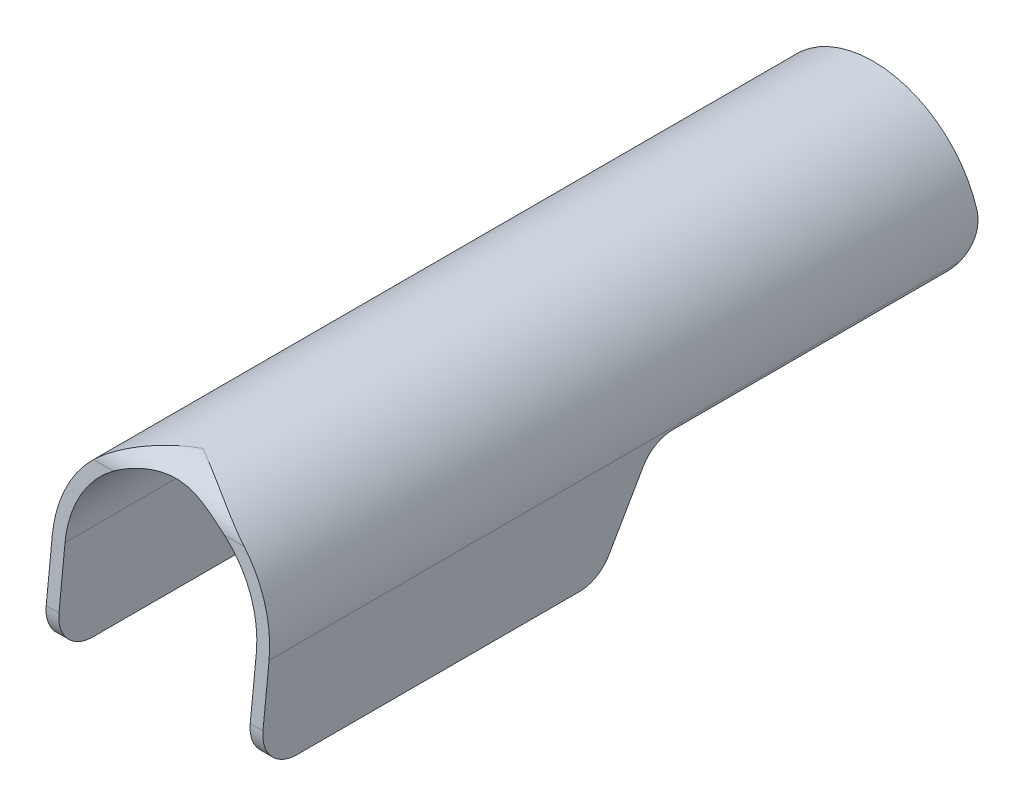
ISO-10303-21;
HEADER;
FILE_DESCRIPTION(('STEP AP214'),'2;1');
FILE_NAME('part.step','',(''),(''),'','','');
FILE_SCHEMA(('AUTOMOTIVE_DESIGN { 1 0 10303 214 1 1 1 1 }'));
ENDSEC;
DATA;
#1=APPLICATION_CONTEXT('core data for automotive mechanical design processes');
#2=APPLICATION_PROTOCOL_DEFINITION('international standard','automotive_design',2000,#1);
#3=PRODUCT_CONTEXT('',#1,'mechanical');
#4=PRODUCT('Part','Part','',(#3));
#5=PRODUCT_RELATED_PRODUCT_CATEGORY('part','',(#4));
#6=PRODUCT_DEFINITION_FORMATION('','',#4);
#7=PRODUCT_DEFINITION_CONTEXT('part definition',#1,'design');
#8=PRODUCT_DEFINITION('design','',#6,#7);
#9=PRODUCT_DEFINITION_SHAPE('','',#8);
#10=(LENGTH_UNIT() NAMED_UNIT(*) SI_UNIT(.MILLI.,.METRE.));
#11=(NAMED_UNIT(*) PLANE_ANGLE_UNIT() SI_UNIT($,.RADIAN.));
#12=(NAMED_UNIT(*) SI_UNIT($,.STERADIAN.) SOLID_ANGLE_UNIT());
#13=UNCERTAINTY_MEASURE_WITH_UNIT(LENGTH_MEASURE(1.E-05),#10,'distance_accuracy_value','');
#14=(GEOMETRIC_REPRESENTATION_CONTEXT(3) GLOBAL_UNCERTAINTY_ASSIGNED_CONTEXT((#13)) GLOBAL_UNIT_ASSIGNED_CONTEXT((#10,
#11,#12)) REPRESENTATION_CONTEXT('',''));
#15=CARTESIAN_POINT('',(0.,0.,0.));
#16=DIRECTION('',(0.,0.,1.));
#17=DIRECTION('',(1.,0.,0.));
#18=AXIS2_PLACEMENT_3D('',#15,#16,#17);
#19=CARTESIAN_POINT('',(-25.5,0.,170.));
#20=DIRECTION('',(1.,0.,0.));
#21=DIRECTION('',(0.,1.,0.));
#22=AXIS2_PLACEMENT_3D('',#19,#20,#21);
#23=PLANE('',#22);
#24=CARTESIAN_POINT('',(-25.5,-14.5,161.115099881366));
#25=DIRECTION('',(1.,0.,0.));
#26=DIRECTION('',(0.,0.,-1.));
#27=AXIS2_PLACEMENT_3D('',#24,#25,#26);
#28=CIRCLE('',#27,8.);
#29=CARTESIAN_POINT('',(-25.5,-13.6637722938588,169.071275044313));
#30=VERTEX_POINT('',#29);
#31=CARTESIAN_POINT('',(-25.5,-22.5,161.115099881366));
#32=VERTEX_POINT('',#31);
#33=EDGE_CURVE('E367',#30,#32,#28,.T.);
#34=ORIENTED_EDGE('',*,*,#33,.F.);
#35=DIRECTION('',(0.,-0.994521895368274,0.104528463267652));
#36=VECTOR('',#35,1.);
#37=CARTESIAN_POINT('',(-25.5,18.3362277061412,165.707939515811));
#38=LINE('',#37,#36);
#39=CARTESIAN_POINT('',(-25.5,0.,167.635154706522));
#40=VERTEX_POINT('',#39);
#41=EDGE_CURVE('E209',#40,#30,#38,.T.);
#42=ORIENTED_EDGE('',*,*,#41,.F.);
#43=DIRECTION('',(0.,0.,-1.));
#44=VECTOR('',#43,1.);
#45=CARTESIAN_POINT('',(-25.5,0.,170.));
#46=LINE('',#45,#44);
#47=CARTESIAN_POINT('',(-25.5,0.,5.21611781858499));
#48=VERTEX_POINT('',#47);
#49=EDGE_CURVE('E229',#40,#48,#46,.T.);
#50=ORIENTED_EDGE('',*,*,#49,.T.);
#51=CARTESIAN_POINT('',(-25.5,7.5,8.));
#52=DIRECTION('',(1.,0.,0.));
#53=DIRECTION('',(0.,0.,-1.));
#54=AXIS2_PLACEMENT_3D('',#51,#52,#53);
#55=CIRCLE('',#54,8.);
#56=CARTESIAN_POINT('',(-25.5,-0.5,8.));
#57=VERTEX_POINT('',#56);
#58=EDGE_CURVE('E353',#57,#48,#55,.T.);
#59=ORIENTED_EDGE('',*,*,#58,.F.);
#60=DIRECTION('',(0.,0.,-1.));
#61=VECTOR('',#60,1.);
#62=CARTESIAN_POINT('',(-25.5,-0.5,72.6794919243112));
#63=LINE('',#62,#61);
#64=CARTESIAN_POINT('',(-25.5,-0.5,72.6794919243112));
#65=VERTEX_POINT('',#64);
#66=EDGE_CURVE('E355',#65,#57,#63,.T.);
#67=ORIENTED_EDGE('',*,*,#66,.F.);
#68=CARTESIAN_POINT('',(-25.5,-8.5,72.6794919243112));
#69=DIRECTION('',(-1.,0.,0.));
#70=DIRECTION('',(0.,0.,1.));
#71=AXIS2_PLACEMENT_3D('',#68,#69,#70);
#72=CIRCLE('',#71,7.99999999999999);
#73=CARTESIAN_POINT('',(-25.5,-4.49999999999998,79.6076951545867));
#74=VERTEX_POINT('',#73);
#75=EDGE_CURVE('E358',#74,#65,#72,.T.);
#76=ORIENTED_EDGE('',*,*,#75,.F.);
#77=DIRECTION('',(0.,0.866025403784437,-0.500000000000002));
#78=VECTOR('',#77,1.);
#79=CARTESIAN_POINT('',(-25.5,-18.5,87.6905989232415));
#80=LINE('',#79,#78);
#81=CARTESIAN_POINT('',(-25.5,-18.5,87.6905989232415));
#82=VERTEX_POINT('',#81);
#83=EDGE_CURVE('E361',#82,#74,#80,.T.);
#84=ORIENTED_EDGE('',*,*,#83,.F.);
#85=CARTESIAN_POINT('',(-25.5,-14.5,94.618802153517));
#86=DIRECTION('',(1.,0.,0.));
#87=DIRECTION('',(0.,0.,-1.));
#88=AXIS2_PLACEMENT_3D('',#85,#86,#87);
#89=CIRCLE('',#88,7.99999999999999);
#90=CARTESIAN_POINT('',(-25.5,-22.5,94.618802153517));
#91=VERTEX_POINT('',#90);
#92=EDGE_CURVE('E364',#91,#82,#89,.T.);
#93=ORIENTED_EDGE('',*,*,#92,.F.);
#94=DIRECTION('',(0.,0.,-1.));
#95=VECTOR('',#94,1.);
#96=CARTESIAN_POINT('',(-25.5,-22.5,170.));
#97=LINE('',#96,#95);
#98=EDGE_CURVE('E241',#32,#91,#97,.T.);
#99=ORIENTED_EDGE('',*,*,#98,.F.);
#100=EDGE_LOOP('',(#34,#42,#50,#59,#67,#76,#84,#93,#99));
#101=FACE_BOUND('',#100,.T.);
#102=ADVANCED_FACE('F39',(#101),#23,.F.);
#103=CARTESIAN_POINT('',(-22.5,-22.5,170.));
#104=DIRECTION('',(0.,-1.,0.));
#105=DIRECTION('',(0.,0.,-1.));
#106=AXIS2_PLACEMENT_3D('',#103,#104,#105);
#107=PLANE('',#106);
#108=DIRECTION('',(1.,0.,0.));
#109=VECTOR('',#108,1.);
#110=CARTESIAN_POINT('',(-25.5,-22.5,161.115099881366));
#111=LINE('',#110,#109);
#112=CARTESIAN_POINT('',(-22.5,-22.5,161.115099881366));
#113=VERTEX_POINT('',#112);
#114=EDGE_CURVE('E208',#32,#113,#111,.T.);
#115=ORIENTED_EDGE('',*,*,#114,.F.);
#116=ORIENTED_EDGE('',*,*,#98,.T.);
#117=DIRECTION('',(1.,0.,0.));
#118=VECTOR('',#117,1.);
#119=CARTESIAN_POINT('',(-25.5,-22.5,94.618802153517));
#120=LINE('',#119,#118);
#121=CARTESIAN_POINT('',(-22.5,-22.5,94.618802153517));
#122=VERTEX_POINT('',#121);
#123=EDGE_CURVE('E327',#91,#122,#120,.T.);
#124=ORIENTED_EDGE('',*,*,#123,.T.);
#125=DIRECTION('',(0.,0.,-1.));
#126=VECTOR('',#125,1.);
#127=CARTESIAN_POINT('',(-22.5,-22.5,170.));
#128=LINE('',#127,#126);
#129=EDGE_CURVE('E238',#113,#122,#128,.T.);
#130=ORIENTED_EDGE('',*,*,#129,.F.);
#131=EDGE_LOOP('',(#115,#116,#124,#130));
#132=FACE_BOUND('',#131,.T.);
#133=ADVANCED_FACE('F475',(#132),#107,.T.);
#134=CARTESIAN_POINT('',(-22.5,0.,170.));
#135=DIRECTION('',(1.,0.,0.));
#136=DIRECTION('',(0.,1.,0.));
#137=AXIS2_PLACEMENT_3D('',#134,#135,#136);
#138=PLANE('',#137);
#139=DIRECTION('',(0.,-0.994521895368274,0.104528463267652));
#140=VECTOR('',#139,1.);
#141=CARTESIAN_POINT('',(-22.5,-0.245839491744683,167.6609934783));
#142=LINE('',#141,#140);
#143=CARTESIAN_POINT('',(-22.5,0.,167.635154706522));
#144=VERTEX_POINT('',#143);
#145=CARTESIAN_POINT('',(-22.5,-13.6637722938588,169.071275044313));
#146=VERTEX_POINT('',#145);
#147=EDGE_CURVE('E441',#144,#146,#142,.T.);
#148=ORIENTED_EDGE('',*,*,#147,.T.);
#149=CARTESIAN_POINT('',(-22.5,-14.5,161.115099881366));
#150=DIRECTION('',(1.,0.,0.));
#151=DIRECTION('',(0.,1.,0.));
#152=AXIS2_PLACEMENT_3D('',#149,#150,#151);
#153=CIRCLE('',#152,8.);
#154=EDGE_CURVE('E418',#146,#113,#153,.T.);
#155=ORIENTED_EDGE('',*,*,#154,.T.);
#156=ORIENTED_EDGE('',*,*,#129,.T.);
#157=CARTESIAN_POINT('',(-22.5,-14.5,94.618802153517));
#158=DIRECTION('',(1.,0.,0.));
#159=DIRECTION('',(0.,1.,0.));
#160=AXIS2_PLACEMENT_3D('',#157,#158,#159);
#161=CIRCLE('',#160,7.99999999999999);
#162=CARTESIAN_POINT('',(-22.5,-18.5,87.6905989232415));
#163=VERTEX_POINT('',#162);
#164=EDGE_CURVE('E437',#122,#163,#161,.T.);
#165=ORIENTED_EDGE('',*,*,#164,.T.);
#166=DIRECTION('',(0.,0.866025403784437,-0.500000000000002));
#167=VECTOR('',#166,1.);
#168=CARTESIAN_POINT('',(-22.5,-40.2660161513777,100.257214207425));
#169=LINE('',#168,#167);
#170=CARTESIAN_POINT('',(-22.5,-4.49999999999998,79.6076951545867));
#171=VERTEX_POINT('',#170);
#172=EDGE_CURVE('E433',#163,#171,#169,.T.);
#173=ORIENTED_EDGE('',*,*,#172,.T.);
#174=CARTESIAN_POINT('',(-22.5,-8.5,72.6794919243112));
#175=DIRECTION('',(1.,0.,0.));
#176=DIRECTION('',(0.,1.,0.));
#177=AXIS2_PLACEMENT_3D('',#174,#175,#176);
#178=CIRCLE('',#177,7.99999999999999);
#179=CARTESIAN_POINT('',(-22.5,-0.5,72.6794919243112));
#180=VERTEX_POINT('',#179);
#181=EDGE_CURVE('E428',#171,#180,#178,.F.);
#182=ORIENTED_EDGE('',*,*,#181,.T.);
#183=DIRECTION('',(0.,0.,-1.));
#184=VECTOR('',#183,1.);
#185=CARTESIAN_POINT('',(-22.5,-0.5,170.));
#186=LINE('',#185,#184);
#187=CARTESIAN_POINT('',(-22.5,-0.5,8.));
#188=VERTEX_POINT('',#187);
#189=EDGE_CURVE('E424',#180,#188,#186,.T.);
#190=ORIENTED_EDGE('',*,*,#189,.T.);
#191=CARTESIAN_POINT('',(-22.5,7.5,8.));
#192=DIRECTION('',(1.,0.,0.));
#193=DIRECTION('',(0.,1.,0.));
#194=AXIS2_PLACEMENT_3D('',#191,#192,#193);
#195=CIRCLE('',#194,8.);
#196=CARTESIAN_POINT('',(-22.5,0.,5.21611781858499));
#197=VERTEX_POINT('',#196);
#198=EDGE_CURVE('E278',#188,#197,#195,.T.);
#199=ORIENTED_EDGE('',*,*,#198,.T.);
#200=DIRECTION('',(0.,0.,-1.));
#201=VECTOR('',#200,1.);
#202=CARTESIAN_POINT('',(-22.5,0.,170.));
#203=LINE('',#202,#201);
#204=EDGE_CURVE('E235',#144,#197,#203,.T.);
#205=ORIENTED_EDGE('',*,*,#204,.F.);
#206=EDGE_LOOP('',(#148,#155,#156,#165,#173,#182,#190,#199,#205));
#207=FACE_BOUND('',#206,.T.);
#208=ADVANCED_FACE('F287',(#207),#138,.T.);
#209=CARTESIAN_POINT('',(0.,0.,170.));
#210=DIRECTION('',(0.,0.,-1.));
#211=DIRECTION('',(-1.,0.,0.));
#212=AXIS2_PLACEMENT_3D('',#209,#210,#211);
#213=CYLINDRICAL_SURFACE('',#212,22.5);
#214=CARTESIAN_POINT('',(-14.142135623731,17.5,149.751764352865));
#215=CARTESIAN_POINT('',(-13.7535062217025,17.8140581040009,149.751765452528));
#216=CARTESIAN_POINT('',(-13.3544405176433,18.1151129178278,149.770223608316));
#217=CARTESIAN_POINT('',(-12.5385736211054,18.6891235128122,149.835357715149));
#218=CARTESIAN_POINT('',(-12.1217595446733,18.9620583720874,149.882054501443));
#219=CARTESIAN_POINT('',(-11.2715413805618,19.4795008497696,149.995992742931));
#220=CARTESIAN_POINT('',(-10.8380820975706,19.7239006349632,150.063308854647));
#221=CARTESIAN_POINT('',(-9.95787143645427,20.1825940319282,150.211092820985));
#222=CARTESIAN_POINT('',(-9.51112243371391,20.3968929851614,150.291558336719));
#223=CARTESIAN_POINT('',(-8.57633634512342,20.8080199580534,150.464114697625));
#224=CARTESIAN_POINT('',(-8.087492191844,21.0028366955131,150.556620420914));
#225=CARTESIAN_POINT('',(-7.097130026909,21.3578437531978,150.740558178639));
#226=CARTESIAN_POINT('',(-6.59561064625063,21.5180303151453,150.831990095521));
#227=CARTESIAN_POINT('',(-5.58233199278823,21.8028389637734,151.005407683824));
#228=CARTESIAN_POINT('',(-5.07060198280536,21.9275503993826,151.087416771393));
#229=CARTESIAN_POINT('',(-4.03726503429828,22.1411091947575,151.234328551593));
#230=CARTESIAN_POINT('',(-3.51565927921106,22.2299608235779,151.299233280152));
#231=CARTESIAN_POINT('',(-2.47874085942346,22.3690006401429,151.403516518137));
#232=CARTESIAN_POINT('',(-1.96362064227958,22.420139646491,151.443518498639));
#233=CARTESIAN_POINT('',(-0.929678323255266,22.4867509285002,151.496033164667));
#234=CARTESIAN_POINT('',(-0.410856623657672,22.502227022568,151.508548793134));
#235=CARTESIAN_POINT('',(0.626558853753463,22.4972560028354,151.50457002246));
#236=CARTESIAN_POINT('',(1.14515259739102,22.4768046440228,151.488072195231));
#237=CARTESIAN_POINT('',(2.17812518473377,22.4003145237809,151.428061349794));
#238=CARTESIAN_POINT('',(2.69250356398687,22.3442718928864,151.384545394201));
#239=CARTESIAN_POINT('',(3.71002490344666,22.197928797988,151.275836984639));
#240=CARTESIAN_POINT('',(4.21322280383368,22.1078845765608,151.210807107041));
#241=CARTESIAN_POINT('',(5.21019322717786,21.8943793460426,151.065505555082));
#242=CARTESIAN_POINT('',(5.70396520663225,21.7709164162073,150.985233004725));
#243=CARTESIAN_POINT('',(6.68170713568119,21.4910197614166,150.816456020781));
#244=CARTESIAN_POINT('',(7.16565512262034,21.3345195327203,150.727935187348));
#245=CARTESIAN_POINT('',(8.12170271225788,20.9891935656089,150.55015059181));
#246=CARTESIAN_POINT('',(8.59380300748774,20.8003697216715,150.460886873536));
#247=CARTESIAN_POINT('',(9.51481466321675,20.3952379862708,150.290880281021));
#248=CARTESIAN_POINT('',(9.96400818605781,20.17963391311,150.209992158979));
#249=CARTESIAN_POINT('',(10.8489382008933,19.718000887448,150.061557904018));
#250=CARTESIAN_POINT('',(11.2846726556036,19.4719673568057,149.994013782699));
#251=CARTESIAN_POINT('',(12.1397862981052,18.9506135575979,149.879865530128));
#252=CARTESIAN_POINT('',(12.5592015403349,18.6753635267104,149.833212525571));
#253=CARTESIAN_POINT('',(13.3800843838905,18.096275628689,149.768703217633));
#254=CARTESIAN_POINT('',(13.7815622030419,17.7924543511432,149.750830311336));
#255=CARTESIAN_POINT('',(14.4183712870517,17.2760257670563,149.752413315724));
#256=CARTESIAN_POINT('',(14.6601687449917,17.071309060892,149.760495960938));
#257=CARTESIAN_POINT('',(15.1342160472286,16.6524901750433,149.794010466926));
#258=CARTESIAN_POINT('',(15.3664685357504,16.438390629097,149.819437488));
#259=CARTESIAN_POINT('',(15.8200379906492,16.0023524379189,149.890098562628));
#260=CARTESIAN_POINT('',(16.0413640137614,15.7804205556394,149.935315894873));
#261=CARTESIAN_POINT('',(16.4718763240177,15.3304971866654,150.048063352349));
#262=CARTESIAN_POINT('',(16.6810649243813,15.1025068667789,150.115589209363));
#263=CARTESIAN_POINT('',(17.0474259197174,14.6866227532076,150.26018507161));
#264=CARTESIAN_POINT('',(17.2069425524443,14.4993192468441,150.333020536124));
#265=CARTESIAN_POINT('',(17.5161730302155,14.1241893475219,150.496028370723));
#266=CARTESIAN_POINT('',(17.6658891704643,13.9363630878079,150.586196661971));
#267=CARTESIAN_POINT('',(17.9547297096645,13.5622097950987,150.78479542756));
#268=CARTESIAN_POINT('',(18.0938548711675,13.3758826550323,150.893224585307));
#269=CARTESIAN_POINT('',(18.3607809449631,13.0070574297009,151.128973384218));
#270=CARTESIAN_POINT('',(18.488581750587,12.824559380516,151.256293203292));
#271=CARTESIAN_POINT('',(18.7332547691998,12.4644676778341,151.531221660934));
#272=CARTESIAN_POINT('',(18.8500250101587,12.286928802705,151.678993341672));
#273=CARTESIAN_POINT('',(19.0709065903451,11.941214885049,151.99376566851));
#274=CARTESIAN_POINT('',(19.1750175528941,11.7730401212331,152.160766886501));
#275=CARTESIAN_POINT('',(19.3702285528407,11.4490184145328,152.513168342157));
#276=CARTESIAN_POINT('',(19.461334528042,11.2931658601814,152.698560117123));
#277=CARTESIAN_POINT('',(19.6304811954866,10.9965165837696,153.086541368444));
#278=CARTESIAN_POINT('',(19.7085240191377,10.8557174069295,153.289128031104));
#279=CARTESIAN_POINT('',(19.8415435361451,10.6103627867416,153.680103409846));
#280=CARTESIAN_POINT('',(19.8982208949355,10.5034959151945,153.866470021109));
#281=CARTESIAN_POINT('',(20.0021409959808,10.3042219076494,154.24928996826));
#282=CARTESIAN_POINT('',(20.0493844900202,10.2118136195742,154.44574249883));
#283=CARTESIAN_POINT('',(20.1346073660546,10.0427364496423,154.847173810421));
#284=CARTESIAN_POINT('',(20.17258937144,9.96606311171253,155.052150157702));
#285=CARTESIAN_POINT('',(20.2395069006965,9.82945342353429,155.469041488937));
#286=CARTESIAN_POINT('',(20.268442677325,9.76951660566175,155.680956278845));
#287=CARTESIAN_POINT('',(20.3158095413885,9.67060908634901,156.095572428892));
#288=CARTESIAN_POINT('',(20.33481514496,9.63050155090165,156.297938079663));
#289=CARTESIAN_POINT('',(20.3652388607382,9.5659982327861,156.705714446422));
#290=CARTESIAN_POINT('',(20.3766573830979,9.5416016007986,156.911124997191));
#291=CARTESIAN_POINT('',(20.3919865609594,9.50879658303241,157.323466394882));
#292=CARTESIAN_POINT('',(20.3958982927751,9.50038590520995,157.530397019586));
#293=CARTESIAN_POINT('',(20.3962457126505,9.49964008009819,157.944295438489));
#294=CARTESIAN_POINT('',(20.392681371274,9.50730499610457,158.151263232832));
#295=CARTESIAN_POINT('',(20.37815324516,9.53840435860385,158.560825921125));
#296=CARTESIAN_POINT('',(20.3672938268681,9.5616163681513,158.76344145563));
#297=CARTESIAN_POINT('',(20.3382079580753,9.62332888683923,159.165791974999));
#298=CARTESIAN_POINT('',(20.3199816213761,9.66182915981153,159.36552700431));
#299=CARTESIAN_POINT('',(20.2760485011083,9.75368881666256,159.760696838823));
#300=CARTESIAN_POINT('',(20.2503421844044,9.80704727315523,159.956131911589));
#301=CARTESIAN_POINT('',(20.1913055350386,9.92802632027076,160.341353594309));
#302=CARTESIAN_POINT('',(20.1579751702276,9.99564697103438,160.531140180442));
#303=CARTESIAN_POINT('',(20.0834410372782,10.1445720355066,160.904243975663));
#304=CARTESIAN_POINT('',(20.0422174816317,10.2259107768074,161.087543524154));
#305=CARTESIAN_POINT('',(19.95180396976,10.4012133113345,161.445952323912));
#306=CARTESIAN_POINT('',(19.9026140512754,10.4951770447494,161.621061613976));
#307=CARTESIAN_POINT('',(19.7961506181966,10.6946338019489,161.96198907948));
#308=CARTESIAN_POINT('',(19.7388776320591,10.8001260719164,162.127807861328));
#309=CARTESIAN_POINT('',(19.6161722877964,11.021423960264,162.449223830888));
#310=CARTESIAN_POINT('',(19.550739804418,11.1372297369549,162.604820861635));
#311=CARTESIAN_POINT('',(19.4100457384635,11.3807009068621,162.908601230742));
#312=CARTESIAN_POINT('',(19.3345869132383,11.5085833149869,163.056519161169));
#313=CARTESIAN_POINT('',(19.1751754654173,11.7722715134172,163.340201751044));
#314=CARTESIAN_POINT('',(19.0912227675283,11.908077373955,163.475966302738));
#315=CARTESIAN_POINT('',(18.9149732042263,12.1860934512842,163.734948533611));
#316=CARTESIAN_POINT('',(18.8226757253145,12.3283041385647,163.85816528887));
#317=CARTESIAN_POINT('',(18.6299737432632,12.6176183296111,164.091869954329));
#318=CARTESIAN_POINT('',(18.5295683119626,12.7647223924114,164.202356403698));
#319=CARTESIAN_POINT('',(18.3128232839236,13.0739768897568,164.41874715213));
#320=CARTESIAN_POINT('',(18.1958516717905,13.2364054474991,164.523620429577));
#321=CARTESIAN_POINT('',(17.9533306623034,13.5635314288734,164.718866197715));
#322=CARTESIAN_POINT('',(17.8277810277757,13.7282289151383,164.809238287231));
#323=CARTESIAN_POINT('',(17.5685869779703,14.0584069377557,164.976005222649));
#324=CARTESIAN_POINT('',(17.4349399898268,14.2238877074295,165.052395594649));
#325=CARTESIAN_POINT('',(17.1601334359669,14.5542445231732,165.191837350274));
#326=CARTESIAN_POINT('',(17.0189723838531,14.7191204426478,165.254886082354));
#327=CARTESIAN_POINT('',(16.6549209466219,15.1318689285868,165.397758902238));
#328=CARTESIAN_POINT('',(16.4274933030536,15.3786002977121,165.469414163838));
#329=CARTESIAN_POINT('',(15.9585338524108,15.8647229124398,165.586843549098));
#330=CARTESIAN_POINT('',(15.7169961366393,16.1041110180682,165.6326067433));
#331=CARTESIAN_POINT('',(15.2211631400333,16.5735618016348,165.701487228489));
#332=CARTESIAN_POINT('',(14.9668456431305,16.8036068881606,165.724563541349));
#333=CARTESIAN_POINT('',(14.447424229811,17.2522403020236,165.751083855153));
#334=CARTESIAN_POINT('',(14.182320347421,17.4708286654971,165.754527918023));
#335=CARTESIAN_POINT('',(13.5070260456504,18.0021143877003,165.74236603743));
#336=CARTESIAN_POINT('',(13.090819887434,18.3069584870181,165.716327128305));
#337=CARTESIAN_POINT('',(12.2403108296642,18.8862373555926,165.636172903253));
#338=CARTESIAN_POINT('',(11.8059983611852,19.1606557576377,165.582042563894));
#339=CARTESIAN_POINT('',(10.9208382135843,19.6786400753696,165.454026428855));
#340=CARTESIAN_POINT('',(10.469953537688,19.9221307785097,165.380093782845));
#341=CARTESIAN_POINT('',(9.55446193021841,20.3770352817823,165.220416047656));
#342=CARTESIAN_POINT('',(9.08985660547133,20.5884528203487,165.134672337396));
#343=CARTESIAN_POINT('',(8.11896696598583,20.991077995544,164.953435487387));
#344=CARTESIAN_POINT('',(7.61188117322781,21.180229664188,164.85766730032));
#345=CARTESIAN_POINT('',(6.58470669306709,21.5217245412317,164.670122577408));
#346=CARTESIAN_POINT('',(6.06461712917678,21.6740652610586,164.578346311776));
#347=CARTESIAN_POINT('',(5.01448329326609,21.9407663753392,164.407937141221));
#348=CARTESIAN_POINT('',(4.4844797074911,22.0552564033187,164.329259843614));
#349=CARTESIAN_POINT('',(3.68241033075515,22.1982806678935,164.227067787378));
#350=CARTESIAN_POINT('',(3.41384449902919,22.2411736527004,164.195638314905));
#351=CARTESIAN_POINT('',(2.87470406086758,22.3172616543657,164.13895872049));
#352=CARTESIAN_POINT('',(2.60412965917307,22.3504576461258,164.113707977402));
#353=CARTESIAN_POINT('',(2.02787173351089,22.4105264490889,164.067486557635));
#354=CARTESIAN_POINT('',(1.72197899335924,22.4361120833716,164.047429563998));
#355=CARTESIAN_POINT('',(1.10891506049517,22.4747556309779,164.016939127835));
#356=CARTESIAN_POINT('',(0.801743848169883,22.4878133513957,164.006505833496));
#357=CARTESIAN_POINT('',(0.186951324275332,22.5013240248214,163.995708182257));
#358=CARTESIAN_POINT('',(-0.120669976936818,22.5017772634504,163.995343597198));
#359=CARTESIAN_POINT('',(-0.735515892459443,22.4900769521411,164.004698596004));
#360=CARTESIAN_POINT('',(-1.04274050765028,22.4779234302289,164.014418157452));
#361=CARTESIAN_POINT('',(-1.65699279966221,22.4410195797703,164.043574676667));
#362=CARTESIAN_POINT('',(-1.96401641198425,22.4162274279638,164.063043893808));
#363=CARTESIAN_POINT('',(-2.57609092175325,22.3541581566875,164.110905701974));
#364=CARTESIAN_POINT('',(-2.88114180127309,22.3168809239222,164.139298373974));
#365=CARTESIAN_POINT('',(-3.48868927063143,22.2300073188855,164.203892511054));
#366=CARTESIAN_POINT('',(-3.79118549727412,22.1804092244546,164.240095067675));
#367=CARTESIAN_POINT('',(-4.39310190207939,22.0690816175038,164.318965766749));
#368=CARTESIAN_POINT('',(-4.69252163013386,22.0073503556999,164.361634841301));
#369=CARTESIAN_POINT('',(-5.60954264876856,21.7987704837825,164.500787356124));
#370=CARTESIAN_POINT('',(-6.22145668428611,21.6320102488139,164.605611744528));
#371=CARTESIAN_POINT('',(-7.42780507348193,21.2480276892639,164.822894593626));
#372=CARTESIAN_POINT('',(-8.02223575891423,21.0307948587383,164.935354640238));
#373=CARTESIAN_POINT('',(-9.1908085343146,20.5469769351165,165.153540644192));
#374=CARTESIAN_POINT('',(-9.76498260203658,20.280474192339,165.259277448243));
#375=CARTESIAN_POINT('',(-10.8913758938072,19.6984559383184,165.449850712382));
#376=CARTESIAN_POINT('',(-11.4436100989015,19.3829746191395,165.534701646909));
#377=CARTESIAN_POINT('',(-12.2982311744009,18.8452209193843,165.640440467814));
#378=CARTESIAN_POINT('',(-12.6091037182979,18.6386753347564,165.673256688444));
#379=CARTESIAN_POINT('',(-13.2210663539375,18.2096938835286,165.723148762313));
#380=CARTESIAN_POINT('',(-13.5221569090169,17.987258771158,165.74022536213));
#381=CARTESIAN_POINT('',(-14.1128610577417,17.527608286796,165.755017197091));
#382=CARTESIAN_POINT('',(-14.4024869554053,17.2904095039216,165.752753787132));
#383=CARTESIAN_POINT('',(-14.9689196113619,16.8024119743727,165.725036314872));
#384=CARTESIAN_POINT('',(-15.245729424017,16.5516164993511,165.699587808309));
#385=CARTESIAN_POINT('',(-15.7249522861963,16.0953374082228,165.630073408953));
#386=CARTESIAN_POINT('',(-15.9302815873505,15.8920968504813,165.59136847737));
#387=CARTESIAN_POINT('',(-16.3308731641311,15.4801503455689,165.495465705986));
#388=CARTESIAN_POINT('',(-16.5261378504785,15.2714457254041,165.438272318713));
#389=CARTESIAN_POINT('',(-16.9052967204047,14.8506256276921,165.30355721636));
#390=CARTESIAN_POINT('',(-17.0892015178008,14.6385135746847,165.226054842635));
#391=CARTESIAN_POINT('',(-17.4446144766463,14.2130990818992,165.048977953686));
#392=CARTESIAN_POINT('',(-17.6161251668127,13.9997968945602,164.949407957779));
#393=CARTESIAN_POINT('',(-17.9144401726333,13.6150809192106,164.747852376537));
#394=CARTESIAN_POINT('',(-18.0435698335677,13.4433650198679,164.649875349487));
#395=CARTESIAN_POINT('',(-18.2923024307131,13.10290377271,164.437998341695));
#396=CARTESIAN_POINT('',(-18.4119073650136,12.9341578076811,164.324101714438));
#397=CARTESIAN_POINT('',(-18.6410868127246,12.601613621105,164.080139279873));
#398=CARTESIAN_POINT('',(-18.7506621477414,12.4378149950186,163.950074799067));
#399=CARTESIAN_POINT('',(-18.9593865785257,12.1172705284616,163.673840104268));
#400=CARTESIAN_POINT('',(-19.0585354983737,11.9605248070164,163.527669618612));
#401=CARTESIAN_POINT('',(-19.2466483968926,11.6554208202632,163.218781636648));
#402=CARTESIAN_POINT('',(-19.3355520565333,11.5071145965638,163.055975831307));
#403=CARTESIAN_POINT('',(-19.5023818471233,11.2220492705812,162.715297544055));
#404=CARTESIAN_POINT('',(-19.5803077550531,11.085290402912,162.537424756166));
#405=CARTESIAN_POINT('',(-19.7251609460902,10.8254405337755,162.167790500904));
#406=CARTESIAN_POINT('',(-19.7920897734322,10.7023476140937,161.976030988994));
#407=CARTESIAN_POINT('',(-19.9150676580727,10.4717320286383,161.580070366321));
#408=CARTESIAN_POINT('',(-19.9711177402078,10.3642078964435,161.375870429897));
#409=CARTESIAN_POINT('',(-20.0675413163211,10.1761402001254,160.977401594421));
#410=CARTESIAN_POINT('',(-20.1089148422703,10.0939826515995,160.784133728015));
#411=CARTESIAN_POINT('',(-20.1831568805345,9.94470383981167,160.390294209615));
#412=CARTESIAN_POINT('',(-20.2160257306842,9.87758197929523,160.189722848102));
#413=CARTESIAN_POINT('',(-20.2734288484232,9.75922193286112,159.782833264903));
#414=CARTESIAN_POINT('',(-20.2979649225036,9.70798030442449,159.576516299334));
#415=CARTESIAN_POINT('',(-20.3388694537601,9.62198844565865,159.159677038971));
#416=CARTESIAN_POINT('',(-20.3552380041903,9.58723802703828,158.949154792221));
#417=CARTESIAN_POINT('',(-20.3794331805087,9.53569493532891,158.533973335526));
#418=CARTESIAN_POINT('',(-20.3875736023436,9.518243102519,158.329413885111));
#419=CARTESIAN_POINT('',(-20.3964886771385,9.49912432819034,157.919404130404));
#420=CARTESIAN_POINT('',(-20.3972636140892,9.49745677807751,157.713953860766));
#421=CARTESIAN_POINT('',(-20.3914541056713,9.50992354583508,157.303657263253));
#422=CARTESIAN_POINT('',(-20.3848703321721,9.5240564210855,157.098810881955));
#423=CARTESIAN_POINT('',(-20.3642978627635,9.56796524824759,156.691176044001));
#424=CARTESIAN_POINT('',(-20.3503091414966,9.5977412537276,156.488387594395));
#425=CARTESIAN_POINT('',(-20.3149467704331,9.67236413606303,156.087613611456));
#426=CARTESIAN_POINT('',(-20.2936210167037,9.7171132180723,155.889605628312));
#427=CARTESIAN_POINT('',(-20.2434386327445,9.82122844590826,155.498449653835));
#428=CARTESIAN_POINT('',(-20.2145820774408,9.8805944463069,155.305301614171));
#429=CARTESIAN_POINT('',(-20.1491904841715,10.0132705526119,154.92521226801));
#430=CARTESIAN_POINT('',(-20.1126560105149,10.0865796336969,154.738270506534));
#431=CARTESIAN_POINT('',(-20.0317534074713,10.2463097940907,154.371834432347));
#432=CARTESIAN_POINT('',(-19.9873852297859,10.3327309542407,154.192340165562));
#433=CARTESIAN_POINT('',(-19.8902980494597,10.5184171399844,153.840579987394));
#434=CARTESIAN_POINT('',(-19.8375163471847,10.6177774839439,153.668381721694));
#435=CARTESIAN_POINT('',(-19.7237517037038,10.827643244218,153.333771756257));
#436=CARTESIAN_POINT('',(-19.6627687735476,10.9381486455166,153.171360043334));
#437=CARTESIAN_POINT('',(-19.5325542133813,11.1690143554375,152.857214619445));
#438=CARTESIAN_POINT('',(-19.4633228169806,11.2893743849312,152.705480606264));
#439=CARTESIAN_POINT('',(-19.3166305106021,11.5385738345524,152.413388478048));
#440=CARTESIAN_POINT('',(-19.2391694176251,11.6674134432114,152.273030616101));
#441=CARTESIAN_POINT('',(-19.0729916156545,11.9372121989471,151.999046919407));
#442=CARTESIAN_POINT('',(-18.9839574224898,12.0784465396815,151.865884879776));
#443=CARTESIAN_POINT('',(-18.7973254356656,12.3668938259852,151.612704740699));
#444=CARTESIAN_POINT('',(-18.6997274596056,12.51410689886,151.492686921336));
#445=CARTESIAN_POINT('',(-18.4962376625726,12.812957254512,151.265869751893));
#446=CARTESIAN_POINT('',(-18.3903442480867,12.964595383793,151.159072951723));
#447=CARTESIAN_POINT('',(-18.1706324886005,13.2707811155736,150.958591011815));
#448=CARTESIAN_POINT('',(-18.0568131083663,13.425329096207,150.864907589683));
#449=CARTESIAN_POINT('',(-17.8090432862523,13.7526174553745,150.680976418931));
#450=CARTESIAN_POINT('',(-17.6742436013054,13.9255291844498,150.592178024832));
#451=CARTESIAN_POINT('',(-17.3960666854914,14.2715156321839,150.429644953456));
#452=CARTESIAN_POINT('',(-17.2526887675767,14.4445903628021,150.355911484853));
#453=CARTESIAN_POINT('',(-16.9579845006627,14.7894622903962,150.222676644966));
#454=CARTESIAN_POINT('',(-16.8066572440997,14.9612593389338,150.163176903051));
#455=CARTESIAN_POINT('',(-16.4966981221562,15.3023577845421,150.057463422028));
#456=CARTESIAN_POINT('',(-16.3380643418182,15.4716585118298,150.011253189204));
#457=CARTESIAN_POINT('',(-15.8597876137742,15.9663300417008,149.892949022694));
#458=CARTESIAN_POINT('',(-15.5306687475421,16.2868010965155,149.838109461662));
#459=CARTESIAN_POINT('',(-14.8513798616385,16.9085468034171,149.767519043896));
#460=CARTESIAN_POINT('',(-14.5012124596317,17.2098238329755,149.751763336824));
#461=CARTESIAN_POINT('',(-14.142135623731,17.5,149.751764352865));
#462=B_SPLINE_CURVE_WITH_KNOTS('',3,(#214,#215,#216,#217,#218,#219,#220,#221,#222,#223,#224,
#225,#226,#227,#228,#229,#230,#231,#232,#233,#234,#235,#236,#237,#238,#239,#240,#241,#242,#243,
#244,#245,#246,#247,#248,#249,#250,#251,#252,#253,#254,#255,#256,#257,#258,#259,#260,#261,#262,
#263,#264,#265,#266,#267,#268,#269,#270,#271,#272,#273,#274,#275,#276,#277,#278,#279,#280,#281,
#282,#283,#284,#285,#286,#287,#288,#289,#290,#291,#292,#293,#294,#295,#296,#297,#298,#299,#300,
#301,#302,#303,#304,#305,#306,#307,#308,#309,#310,#311,#312,#313,#314,#315,#316,#317,#318,#319,
#320,#321,#322,#323,#324,#325,#326,#327,#328,#329,#330,#331,#332,#333,#334,#335,#336,#337,#338,
#339,#340,#341,#342,#343,#344,#345,#346,#347,#348,#349,#350,#351,#352,#353,#354,#355,#356,#357,
#358,#359,#360,#361,#362,#363,#364,#365,#366,#367,#368,#369,#370,#371,#372,#373,#374,#375,#376,
#377,#378,#379,#380,#381,#382,#383,#384,#385,#386,#387,#388,#389,#390,#391,#392,#393,#394,#395,
#396,#397,#398,#399,#400,#401,#402,#403,#404,#405,#406,#407,#408,#409,#410,#411,#412,#413,#414,
#415,#416,#417,#418,#419,#420,#421,#422,#423,#424,#425,#426,#427,#428,#429,#430,#431,#432,#433,
#434,#435,#436,#437,#438,#439,#440,#441,#442,#443,#444,#445,#446,#447,#448,#449,#450,#451,#452,
#453,#454,#455,#456,#457,#458,#459,#460,#461),.UNSPECIFIED.,.T.,.F.,(4,2,2,2,2,2,2,2,2,2,2,2,2,
2,2,2,2,2,2,2,2,2,2,2,2,2,2,2,2,2,2,2,2,2,2,2,2,2,2,2,2,2,2,2,2,2,2,2,2,2,2,2,2,2,2,2,2,2,2,2,2,
2,2,2,2,2,2,2,2,2,2,2,2,2,2,2,2,2,2,2,2,2,2,2,2,2,2,2,2,2,2,2,2,2,2,2,2,2,2,2,2,2,2,2,2,2,2,2,2,
2,2,2,2,2,2,2,2,2,2,2,2,2,2,4),(0.,1.49846455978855,2.99803607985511,4.50310260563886,
6.00790171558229,7.60952236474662,9.21131674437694,10.8090403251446,12.4065736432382,
13.9623066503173,15.5178730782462,17.0736233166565,18.6295427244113,20.1739631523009,
21.7184723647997,23.2661208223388,24.8136786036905,26.326854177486,27.8402576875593,
29.3501019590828,30.859074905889,31.809201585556,32.7590632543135,33.7081239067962,
34.6570030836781,35.4260411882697,36.1948985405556,36.9637004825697,37.7325096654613,
38.5078446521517,39.2832027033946,40.0582056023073,40.8330819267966,41.4987658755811,
42.1643967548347,42.8298388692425,43.4952623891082,44.1160428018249,44.7367896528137,
45.3574474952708,45.9781077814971,46.5900725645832,47.202027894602,47.8139450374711,
48.4258647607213,49.0393390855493,49.6528105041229,50.2662418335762,50.8796825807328,
51.5077573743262,52.135837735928,52.763964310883,53.3921628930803,54.0694016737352,
54.7466591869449,55.4241330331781,56.1017413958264,57.1295256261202,58.1577433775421,
59.1878149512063,60.21788327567,61.7651349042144,63.3132148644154,64.8649902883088,
66.4165846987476,68.0640522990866,69.7116312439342,71.3535075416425,72.1746390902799,
72.9956880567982,73.9181337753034,74.8405936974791,75.7630327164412,76.6854696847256,
77.610979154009,78.536497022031,79.4621443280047,80.3879251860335,82.3137752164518,
84.2400264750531,86.1630868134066,88.0848106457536,89.208168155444,90.3314723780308,
91.4535364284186,92.5753316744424,93.4490754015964,94.3226088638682,95.1953134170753,
96.0678394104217,96.7755610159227,97.4831337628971,98.1906484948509,98.8981751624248,
99.6096748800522,100.321189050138,101.032603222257,101.743950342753,102.38527578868,
103.026575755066,103.667736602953,104.308890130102,104.924547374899,105.540180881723,
106.155758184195,106.771337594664,107.3829724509,107.994601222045,108.60618505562,
109.217772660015,109.834151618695,110.45052974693,111.066890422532,111.683264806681,
112.323248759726,112.963246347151,113.60336717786,114.243571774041,114.952527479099,
115.661540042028,116.370633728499,117.079914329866,118.464602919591,119.84911965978),.UNSPECIFIED.);
#463=CARTESIAN_POINT('',(13.0396607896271,18.3362277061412,165.707939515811));
#464=VERTEX_POINT('',#463);
#465=CARTESIAN_POINT('',(-13.0396607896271,18.3362277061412,165.707939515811));
#466=VERTEX_POINT('',#465);
#467=EDGE_CURVE('E269',#464,#466,#462,.T.);
#468=ORIENTED_EDGE('',*,*,#467,.T.);
#469=CARTESIAN_POINT('',(0.,0.,167.635154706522));
#470=DIRECTION('',(0.,0.104528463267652,0.994521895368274));
#471=DIRECTION('',(0.,0.994521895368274,-0.104528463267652));
#472=AXIS2_PLACEMENT_3D('',#469,#470,#471);
#473=ELLIPSE('',#472,22.6239362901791,22.5);
#474=EDGE_CURVE('E443',#466,#144,#473,.T.);
#475=ORIENTED_EDGE('',*,*,#474,.T.);
#476=ORIENTED_EDGE('',*,*,#204,.T.);
#477=CARTESIAN_POINT('',(-22.5,0.,5.21611781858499));
#478=CARTESIAN_POINT('',(-22.4999857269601,0.0773517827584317,5.00765728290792));
#479=CARTESIAN_POINT('',(-22.499601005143,0.163438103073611,4.80243836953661));
#480=CARTESIAN_POINT('',(-22.4974425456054,0.352383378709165,4.39987285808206));
#481=CARTESIAN_POINT('',(-22.4956687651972,0.455242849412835,4.20252650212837));
#482=CARTESIAN_POINT('',(-22.4900823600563,0.677097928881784,3.81699558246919));
#483=CARTESIAN_POINT('',(-22.4862685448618,0.796102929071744,3.62881643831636));
#484=CARTESIAN_POINT('',(-22.475875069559,1.04933512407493,3.26308277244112));
#485=CARTESIAN_POINT('',(-22.4692955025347,1.18356180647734,3.08552789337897));
#486=CARTESIAN_POINT('',(-22.452611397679,1.46639676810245,2.74213329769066));
#487=CARTESIAN_POINT('',(-22.4425032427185,1.61501969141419,2.57630581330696));
#488=CARTESIAN_POINT('',(-22.4180079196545,1.92539529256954,2.25776783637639));
#489=CARTESIAN_POINT('',(-22.4036207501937,2.08714797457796,2.1050573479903));
#490=CARTESIAN_POINT('',(-22.3698584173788,2.42234903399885,1.8139928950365));
#491=CARTESIAN_POINT('',(-22.350487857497,2.5957865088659,1.67562584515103));
#492=CARTESIAN_POINT('',(-22.3060929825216,2.95306811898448,1.41407395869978));
#493=CARTESIAN_POINT('',(-22.2810688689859,3.13691188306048,1.29088858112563));
#494=CARTESIAN_POINT('',(-22.2252821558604,3.51024760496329,1.06249756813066));
#495=CARTESIAN_POINT('',(-22.1946248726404,3.69958945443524,0.957020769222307));
#496=CARTESIAN_POINT('',(-22.1268819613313,4.08526969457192,0.762161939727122));
#497=CARTESIAN_POINT('',(-22.0897964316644,4.2816079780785,0.672779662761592));
#498=CARTESIAN_POINT('',(-22.0088861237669,4.67976450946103,0.510507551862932));
#499=CARTESIAN_POINT('',(-21.9650579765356,4.88158545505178,0.437626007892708));
#500=CARTESIAN_POINT('',(-21.8705640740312,5.2888736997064,0.308668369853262));
#501=CARTESIAN_POINT('',(-21.8198995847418,5.49434031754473,0.252589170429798));
#502=CARTESIAN_POINT('',(-21.6874965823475,5.99980662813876,0.135944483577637));
#503=CARTESIAN_POINT('',(-21.6019898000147,6.30101731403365,0.084574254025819));
#504=CARTESIAN_POINT('',(-21.4635730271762,6.75202415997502,0.0336056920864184));
#505=CARTESIAN_POINT('',(-21.4157913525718,6.90208325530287,0.0209636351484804));
#506=CARTESIAN_POINT('',(-21.3169369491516,7.20160179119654,0.00416173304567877));
#507=CARTESIAN_POINT('',(-21.2658640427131,7.35106119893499,2.34607339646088E-06));
#508=CARTESIAN_POINT('',(-21.2132034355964,7.5,0.));
#509=B_SPLINE_CURVE_WITH_KNOTS('',3,(#477,#478,#479,#480,#481,#482,#483,#484,#485,#486,#487,
#488,#489,#490,#491,#492,#493,#494,#495,#496,#497,#498,#499,#500,#501,#502,#503,#504,#505,#506,
#507,#508),.UNSPECIFIED.,.F.,.F.,(4,2,2,2,2,2,2,2,2,2,2,2,2,2,2,4),(0.,0.666853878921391,
1.33372825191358,2.00099220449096,2.6682337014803,3.33616120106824,4.00408891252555,
4.67140181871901,5.33869093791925,5.99458247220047,6.65046396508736,7.30667424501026,
7.96276317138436,8.9120591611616,9.38581114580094,9.85958871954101),.UNSPECIFIED.);
#510=CARTESIAN_POINT('',(-21.2132034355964,7.5,0.));
#511=VERTEX_POINT('',#510);
#512=EDGE_CURVE('E298',#197,#511,#509,.T.);
#513=ORIENTED_EDGE('',*,*,#512,.T.);
#514=CARTESIAN_POINT('',(0.,0.,0.));
#515=DIRECTION('',(0.,0.,1.));
#516=DIRECTION('',(1.,0.,0.));
#517=AXIS2_PLACEMENT_3D('',#514,#515,#516);
#518=CIRCLE('',#517,22.5);
#519=CARTESIAN_POINT('',(21.2132034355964,7.5,0.));
#520=VERTEX_POINT('',#519);
#521=EDGE_CURVE('E415',#520,#511,#518,.T.);
#522=ORIENTED_EDGE('',*,*,#521,.F.);
#523=CARTESIAN_POINT('',(21.2132034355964,7.5,0.));
#524=CARTESIAN_POINT('',(21.2871888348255,7.29082565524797,-2.62992043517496E-05));
#525=CARTESIAN_POINT('',(21.3580370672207,7.08050603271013,0.00820367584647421));
#526=CARTESIAN_POINT('',(21.4931604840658,6.65903064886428,0.0415225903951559));
#527=CARTESIAN_POINT('',(21.55743378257,6.44787466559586,0.0666163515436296));
#528=CARTESIAN_POINT('',(21.6790721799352,6.02628070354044,0.134013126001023));
#529=CARTESIAN_POINT('',(21.7364365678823,5.81584280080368,0.176317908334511));
#530=CARTESIAN_POINT('',(21.8441022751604,5.39739197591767,0.278251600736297));
#531=CARTESIAN_POINT('',(21.8944044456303,5.18937876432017,0.337878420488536));
#532=CARTESIAN_POINT('',(21.988064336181,4.7770114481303,0.474535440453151));
#533=CARTESIAN_POINT('',(22.0314065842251,4.57266636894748,0.551603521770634));
#534=CARTESIAN_POINT('',(22.1111862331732,4.16984467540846,0.722778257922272));
#535=CARTESIAN_POINT('',(22.1476235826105,3.97136810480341,0.816885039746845));
#536=CARTESIAN_POINT('',(22.2138966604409,3.58214245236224,1.02155448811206));
#537=CARTESIAN_POINT('',(22.2437375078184,3.39138747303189,1.13210428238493));
#538=CARTESIAN_POINT('',(22.297322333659,3.01907180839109,1.36901464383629));
#539=CARTESIAN_POINT('',(22.321066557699,2.83751075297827,1.49537457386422));
#540=CARTESIAN_POINT('',(22.3625058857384,2.48962487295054,1.75959788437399));
#541=CARTESIAN_POINT('',(22.3803408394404,2.32302831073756,1.89708190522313));
#542=CARTESIAN_POINT('',(22.4114041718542,2.00127265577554,2.18530717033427));
#543=CARTESIAN_POINT('',(22.424632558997,1.84611354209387,2.3360483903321));
#544=CARTESIAN_POINT('',(22.4471601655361,1.5483256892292,2.64982616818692));
#545=CARTESIAN_POINT('',(22.4564579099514,1.40570166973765,2.8128673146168));
#546=CARTESIAN_POINT('',(22.4718106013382,1.13411891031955,3.15000516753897));
#547=CARTESIAN_POINT('',(22.4778660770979,1.00515794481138,3.32410006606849));
#548=CARTESIAN_POINT('',(22.4897676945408,0.702319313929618,3.76972830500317));
#549=CARTESIAN_POINT('',(22.4940712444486,0.537211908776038,4.04737134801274));
#550=CARTESIAN_POINT('',(22.4979042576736,0.31580190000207,4.47675579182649));
#551=CARTESIAN_POINT('',(22.498745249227,0.24641874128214,4.62191609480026));
#552=CARTESIAN_POINT('',(22.4997911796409,0.116512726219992,4.91617824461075));
#553=CARTESIAN_POINT('',(22.4999960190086,0.0559912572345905,5.06528070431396));
#554=CARTESIAN_POINT('',(22.5,0.,5.21611781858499));
#555=B_SPLINE_CURVE_WITH_KNOTS('',3,(#523,#524,#525,#526,#527,#528,#529,#530,#531,#532,#533,
#534,#535,#536,#537,#538,#539,#540,#541,#542,#543,#544,#545,#546,#547,#548,#549,#550,#551,#552,
#553,#554),.UNSPECIFIED.,.F.,.F.,(4,2,2,2,2,2,2,2,2,2,2,2,2,2,2,4),(0.,0.665492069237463,
1.33117449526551,1.99692536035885,2.66259592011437,3.3297263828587,3.9968618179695,
4.66347771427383,5.33006675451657,5.97951477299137,6.62896160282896,7.27865192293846,
7.92823625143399,8.89464376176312,9.37707701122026,9.8595857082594),.UNSPECIFIED.);
#556=CARTESIAN_POINT('',(22.5,0.,5.21611781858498));
#557=VERTEX_POINT('',#556);
#558=EDGE_CURVE('E67',#520,#557,#555,.T.);
#559=ORIENTED_EDGE('',*,*,#558,.T.);
#560=DIRECTION('',(0.,0.,-1.));
#561=VECTOR('',#560,1.);
#562=CARTESIAN_POINT('',(22.5,0.,170.));
#563=LINE('',#562,#561);
#564=CARTESIAN_POINT('',(22.5,0.,167.635154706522));
#565=VERTEX_POINT('',#564);
#566=EDGE_CURVE('E226',#565,#557,#563,.T.);
#567=ORIENTED_EDGE('',*,*,#566,.F.);
#568=EDGE_CURVE('E444',#565,#464,#473,.T.);
#569=ORIENTED_EDGE('',*,*,#568,.T.);
#570=EDGE_LOOP('',(#468,#475,#476,#513,#522,#559,#567,#569));
#571=FACE_BOUND('',#570,.T.);
#572=ADVANCED_FACE('F281',(#571),#213,.F.);
#573=CARTESIAN_POINT('',(22.5,0.,170.));
#574=DIRECTION('',(-1.,0.,0.));
#575=DIRECTION('',(0.,0.,1.));
#576=AXIS2_PLACEMENT_3D('',#573,#574,#575);
#577=PLANE('',#576);
#578=DIRECTION('',(0.,0.,-1.));
#579=VECTOR('',#578,1.);
#580=CARTESIAN_POINT('',(22.5,-22.5,170.));
#581=LINE('',#580,#579);
#582=CARTESIAN_POINT('',(22.5,-22.5,161.115099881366));
#583=VERTEX_POINT('',#582);
#584=CARTESIAN_POINT('',(22.5,-22.5,94.618802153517));
#585=VERTEX_POINT('',#584);
#586=EDGE_CURVE('E223',#583,#585,#581,.T.);
#587=ORIENTED_EDGE('',*,*,#586,.F.);
#588=CARTESIAN_POINT('',(22.5,-14.5,161.115099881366));
#589=DIRECTION('',(-1.,0.,0.));
#590=DIRECTION('',(0.,0.,1.));
#591=AXIS2_PLACEMENT_3D('',#588,#589,#590);
#592=CIRCLE('',#591,8.);
#593=CARTESIAN_POINT('',(22.5,-13.6637722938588,169.071275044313));
#594=VERTEX_POINT('',#593);
#595=EDGE_CURVE('E203',#583,#594,#592,.T.);
#596=ORIENTED_EDGE('',*,*,#595,.T.);
#597=DIRECTION('',(0.,0.994521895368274,-0.104528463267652));
#598=VECTOR('',#597,1.);
#599=CARTESIAN_POINT('',(22.5,-0.245839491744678,167.6609934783));
#600=LINE('',#599,#598);
#601=EDGE_CURVE('E277',#594,#565,#600,.T.);
#602=ORIENTED_EDGE('',*,*,#601,.T.);
#603=ORIENTED_EDGE('',*,*,#566,.T.);
#604=CARTESIAN_POINT('',(22.5,7.5,8.));
#605=DIRECTION('',(-1.,0.,0.));
#606=DIRECTION('',(0.,0.,1.));
#607=AXIS2_PLACEMENT_3D('',#604,#605,#606);
#608=CIRCLE('',#607,8.);
#609=CARTESIAN_POINT('',(22.5,-0.5,8.));
#610=VERTEX_POINT('',#609);
#611=EDGE_CURVE('E307',#557,#610,#608,.T.);
#612=ORIENTED_EDGE('',*,*,#611,.T.);
#613=DIRECTION('',(0.,0.,1.));
#614=VECTOR('',#613,1.);
#615=CARTESIAN_POINT('',(22.5,-0.5,170.));
#616=LINE('',#615,#614);
#617=CARTESIAN_POINT('',(22.5,-0.5,72.6794919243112));
#618=VERTEX_POINT('',#617);
#619=EDGE_CURVE('E403',#610,#618,#616,.T.);
#620=ORIENTED_EDGE('',*,*,#619,.T.);
#621=CARTESIAN_POINT('',(22.5,-8.5,72.6794919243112));
#622=DIRECTION('',(-1.,0.,0.));
#623=DIRECTION('',(0.,0.,1.));
#624=AXIS2_PLACEMENT_3D('',#621,#622,#623);
#625=CIRCLE('',#624,7.99999999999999);
#626=CARTESIAN_POINT('',(22.5,-4.49999999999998,79.6076951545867));
#627=VERTEX_POINT('',#626);
#628=EDGE_CURVE('E431',#618,#627,#625,.F.);
#629=ORIENTED_EDGE('',*,*,#628,.T.);
#630=DIRECTION('',(0.,-0.866025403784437,0.500000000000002));
#631=VECTOR('',#630,1.);
#632=CARTESIAN_POINT('',(22.5,-40.2660161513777,100.257214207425));
#633=LINE('',#632,#631);
#634=CARTESIAN_POINT('',(22.5,-18.5,87.6905989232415));
#635=VERTEX_POINT('',#634);
#636=EDGE_CURVE('E393',#627,#635,#633,.T.);
#637=ORIENTED_EDGE('',*,*,#636,.T.);
#638=CARTESIAN_POINT('',(22.5,-14.5,94.618802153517));
#639=DIRECTION('',(-1.,0.,0.));
#640=DIRECTION('',(0.,0.,1.));
#641=AXIS2_PLACEMENT_3D('',#638,#639,#640);
#642=CIRCLE('',#641,7.99999999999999);
#643=EDGE_CURVE('E387',#635,#585,#642,.T.);
#644=ORIENTED_EDGE('',*,*,#643,.T.);
#645=EDGE_LOOP('',(#587,#596,#602,#603,#612,#620,#629,#637,#644));
#646=FACE_BOUND('',#645,.T.);
#647=ADVANCED_FACE('F286',(#646),#577,.T.);
#648=CARTESIAN_POINT('',(25.5,-22.5,170.));
#649=DIRECTION('',(0.,-1.,0.));
#650=DIRECTION('',(0.,0.,-1.));
#651=AXIS2_PLACEMENT_3D('',#648,#649,#650);
#652=PLANE('',#651);
#653=CARTESIAN_POINT('',(25.5,-22.5,161.115099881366));
#654=VERTEX_POINT('',#653);
#655=EDGE_CURVE('E196',#583,#654,#111,.T.);
#656=ORIENTED_EDGE('',*,*,#655,.F.);
#657=ORIENTED_EDGE('',*,*,#586,.T.);
#658=CARTESIAN_POINT('',(25.5,-22.5,94.618802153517));
#659=VERTEX_POINT('',#658);
#660=EDGE_CURVE('E222',#585,#659,#120,.T.);
#661=ORIENTED_EDGE('',*,*,#660,.T.);
#662=DIRECTION('',(0.,0.,-1.));
#663=VECTOR('',#662,1.);
#664=CARTESIAN_POINT('',(25.5,-22.5,170.));
#665=LINE('',#664,#663);
#666=EDGE_CURVE('E215',#654,#659,#665,.T.);
#667=ORIENTED_EDGE('',*,*,#666,.F.);
#668=EDGE_LOOP('',(#656,#657,#661,#667));
#669=FACE_BOUND('',#668,.T.);
#670=ADVANCED_FACE('F221',(#669),#652,.T.);
#671=CARTESIAN_POINT('',(25.5,0.,170.));
#672=DIRECTION('',(-1.,0.,0.));
#673=DIRECTION('',(0.,0.,1.));
#674=AXIS2_PLACEMENT_3D('',#671,#672,#673);
#675=PLANE('',#674);
#676=CARTESIAN_POINT('',(25.5,-14.5,161.115099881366));
#677=DIRECTION('',(1.,0.,0.));
#678=DIRECTION('',(0.,0.,-1.));
#679=AXIS2_PLACEMENT_3D('',#676,#677,#678);
#680=CIRCLE('',#679,8.);
#681=CARTESIAN_POINT('',(25.5,-13.6637722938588,169.071275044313));
#682=VERTEX_POINT('',#681);
#683=EDGE_CURVE('E200',#682,#654,#680,.T.);
#684=ORIENTED_EDGE('',*,*,#683,.T.);
#685=ORIENTED_EDGE('',*,*,#666,.T.);
#686=CARTESIAN_POINT('',(25.5,-14.5,94.618802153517));
#687=DIRECTION('',(1.,0.,0.));
#688=DIRECTION('',(0.,0.,-1.));
#689=AXIS2_PLACEMENT_3D('',#686,#687,#688);
#690=CIRCLE('',#689,7.99999999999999);
#691=CARTESIAN_POINT('',(25.5,-18.5,87.6905989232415));
#692=VERTEX_POINT('',#691);
#693=EDGE_CURVE('E218',#659,#692,#690,.T.);
#694=ORIENTED_EDGE('',*,*,#693,.T.);
#695=DIRECTION('',(0.,0.866025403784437,-0.500000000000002));
#696=VECTOR('',#695,1.);
#697=CARTESIAN_POINT('',(25.5,-18.5,87.6905989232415));
#698=LINE('',#697,#696);
#699=CARTESIAN_POINT('',(25.5,-4.49999999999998,79.6076951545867));
#700=VERTEX_POINT('',#699);
#701=EDGE_CURVE('E379',#692,#700,#698,.T.);
#702=ORIENTED_EDGE('',*,*,#701,.T.);
#703=CARTESIAN_POINT('',(25.5,-8.5,72.6794919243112));
#704=DIRECTION('',(-1.,0.,0.));
#705=DIRECTION('',(0.,0.,1.));
#706=AXIS2_PLACEMENT_3D('',#703,#704,#705);
#707=CIRCLE('',#706,7.99999999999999);
#708=CARTESIAN_POINT('',(25.5,-0.5,72.6794919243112));
#709=VERTEX_POINT('',#708);
#710=EDGE_CURVE('E376',#700,#709,#707,.T.);
#711=ORIENTED_EDGE('',*,*,#710,.T.);
#712=DIRECTION('',(0.,0.,-1.));
#713=VECTOR('',#712,1.);
#714=CARTESIAN_POINT('',(25.5,-0.5,72.6794919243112));
#715=LINE('',#714,#713);
#716=CARTESIAN_POINT('',(25.5,-0.5,8.));
#717=VERTEX_POINT('',#716);
#718=EDGE_CURVE('E373',#709,#717,#715,.T.);
#719=ORIENTED_EDGE('',*,*,#718,.T.);
#720=CARTESIAN_POINT('',(25.5,7.5,8.));
#721=DIRECTION('',(1.,0.,0.));
#722=DIRECTION('',(0.,0.,-1.));
#723=AXIS2_PLACEMENT_3D('',#720,#721,#722);
#724=CIRCLE('',#723,8.);
#725=CARTESIAN_POINT('',(25.5,0.,5.21611781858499));
#726=VERTEX_POINT('',#725);
#727=EDGE_CURVE('E370',#717,#726,#724,.T.);
#728=ORIENTED_EDGE('',*,*,#727,.T.);
#729=DIRECTION('',(0.,0.,-1.));
#730=VECTOR('',#729,1.);
#731=CARTESIAN_POINT('',(25.5,0.,170.));
#732=LINE('',#731,#730);
#733=CARTESIAN_POINT('',(25.5,0.,167.635154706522));
#734=VERTEX_POINT('',#733);
#735=EDGE_CURVE('E224',#734,#726,#732,.T.);
#736=ORIENTED_EDGE('',*,*,#735,.F.);
#737=DIRECTION('',(0.,-0.994521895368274,0.104528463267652));
#738=VECTOR('',#737,1.);
#739=CARTESIAN_POINT('',(25.5,18.3362277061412,165.707939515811));
#740=LINE('',#739,#738);
#741=EDGE_CURVE('E217',#734,#682,#740,.T.);
#742=ORIENTED_EDGE('',*,*,#741,.T.);
#743=EDGE_LOOP('',(#684,#685,#694,#702,#711,#719,#728,#736,#742));
#744=FACE_BOUND('',#743,.T.);
#745=ADVANCED_FACE('F213',(#744),#675,.F.);
#746=CARTESIAN_POINT('',(0.,0.,170.));
#747=DIRECTION('',(0.,0.,-1.));
#748=DIRECTION('',(-1.,0.,0.));
#749=AXIS2_PLACEMENT_3D('',#746,#747,#748);
#750=CYLINDRICAL_SURFACE('',#749,25.5);
#751=CARTESIAN_POINT('',(0.,0.,167.635154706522));
#752=DIRECTION('',(0.,0.104528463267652,0.994521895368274));
#753=DIRECTION('',(0.,0.994521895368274,-0.104528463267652));
#754=AXIS2_PLACEMENT_3D('',#751,#752,#753);
#755=ELLIPSE('',#754,25.6404611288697,25.5);
#756=CARTESIAN_POINT('',(-17.7209693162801,18.3362277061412,165.707939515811));
#757=VERTEX_POINT('',#756);
#758=EDGE_CURVE('E53',#757,#40,#755,.T.);
#759=ORIENTED_EDGE('',*,*,#758,.F.);
#760=CARTESIAN_POINT('',(0.,25.5,157.751764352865));
#761=CARTESIAN_POINT('',(-3.51509218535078E-08,25.5,157.751998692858));
#762=CARTESIAN_POINT('',(-0.000692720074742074,25.4999999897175,157.752233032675));
#763=CARTESIAN_POINT('',(-0.00224364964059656,25.4999999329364,157.752880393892));
#764=CARTESIAN_POINT('',(-0.00282567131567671,25.4999998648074,157.753293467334));
#765=CARTESIAN_POINT('',(-0.00523997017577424,25.4999994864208,157.754854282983));
#766=CARTESIAN_POINT('',(-0.00745340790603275,25.4999989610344,157.756000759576));
#767=CARTESIAN_POINT('',(-0.0160188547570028,25.4999958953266,157.760553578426));
#768=CARTESIAN_POINT('',(-0.0219338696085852,25.4999914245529,157.763962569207));
#769=CARTESIAN_POINT('',(-0.130553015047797,25.4998696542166,157.826398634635));
#770=CARTESIAN_POINT('',(-0.237857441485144,25.4991016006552,157.885397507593));
#771=CARTESIAN_POINT('',(-0.451340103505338,25.496241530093,158.004134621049));
#772=CARTESIAN_POINT('',(-0.557487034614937,25.4941329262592,158.06387279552));
#773=CARTESIAN_POINT('',(-0.771308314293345,25.4885533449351,158.18379286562));
#774=CARTESIAN_POINT('',(-0.878988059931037,25.4850713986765,158.243974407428));
#775=CARTESIAN_POINT('',(-1.09378803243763,25.4767589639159,158.364077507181));
#776=CARTESIAN_POINT('',(-1.2009089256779,25.4719330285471,158.423999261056));
#777=CARTESIAN_POINT('',(-1.51476731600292,25.455809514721,158.599445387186));
#778=CARTESIAN_POINT('',(-1.72151763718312,25.4426668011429,158.714864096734));
#779=CARTESIAN_POINT('',(-2.13414136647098,25.4113782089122,158.944878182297));
#780=CARTESIAN_POINT('',(-2.34001537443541,25.3932494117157,159.059475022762));
#781=CARTESIAN_POINT('',(-2.77303386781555,25.3498012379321,159.30001286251));
#782=CARTESIAN_POINT('',(-3.00015887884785,25.3239293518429,159.425891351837));
#783=CARTESIAN_POINT('',(-3.45432670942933,25.2659867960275,159.676875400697));
#784=CARTESIAN_POINT('',(-3.68136924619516,25.2339102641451,159.80198011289));
#785=CARTESIAN_POINT('',(-4.1370073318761,25.1632423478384,160.052145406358));
#786=CARTESIAN_POINT('',(-4.36559982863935,25.1245982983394,160.177196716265));
#787=CARTESIAN_POINT('',(-4.82228081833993,25.0409561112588,160.425935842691));
#788=CARTESIAN_POINT('',(-5.0503694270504,24.9959596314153,160.54962400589));
#789=CARTESIAN_POINT('',(-5.63238348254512,24.8728228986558,160.863614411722));
#790=CARTESIAN_POINT('',(-5.98595096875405,24.7901400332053,161.052821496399));
#791=CARTESIAN_POINT('',(-6.69076932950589,24.6092603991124,161.426183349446));
#792=CARTESIAN_POINT('',(-7.04202353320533,24.5110970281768,161.61034801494));
#793=CARTESIAN_POINT('',(-7.73598093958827,24.3008956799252,161.969620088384));
#794=CARTESIAN_POINT('',(-8.07871986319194,24.189156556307,162.144833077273));
#795=CARTESIAN_POINT('',(-8.76216725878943,23.950063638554,162.48891428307));
#796=CARTESIAN_POINT('',(-9.10287472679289,23.82270270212,162.657779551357));
#797=CARTESIAN_POINT('',(-9.67349403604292,23.5952425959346,162.935311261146));
#798=CARTESIAN_POINT('',(-9.90411475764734,23.4993891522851,163.046013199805));
#799=CARTESIAN_POINT('',(-10.3639444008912,23.3002452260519,163.263468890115));
#800=CARTESIAN_POINT('',(-10.5931535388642,23.196955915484,163.37022325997));
#801=CARTESIAN_POINT('',(-11.2805339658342,22.8747985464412,163.684888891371));
#802=CARTESIAN_POINT('',(-11.7364329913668,22.6444452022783,163.886211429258));
#803=CARTESIAN_POINT('',(-12.6595856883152,22.1421013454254,164.275266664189));
#804=CARTESIAN_POINT('',(-13.1265017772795,21.8687600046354,164.462061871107));
#805=CARTESIAN_POINT('',(-14.048988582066,21.2878469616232,164.806268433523));
#806=CARTESIAN_POINT('',(-14.5045744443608,20.9803243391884,164.96372107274));
#807=CARTESIAN_POINT('',(-15.2731268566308,20.4239474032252,165.202536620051));
#808=CARTESIAN_POINT('',(-15.5895016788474,20.1835829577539,165.292768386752));
#809=CARTESIAN_POINT('',(-16.2140008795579,19.6854178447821,165.45191615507));
#810=CARTESIAN_POINT('',(-16.5221234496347,19.4276133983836,165.520827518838));
#811=CARTESIAN_POINT('',(-17.1253114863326,18.8979673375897,165.633276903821));
#812=CARTESIAN_POINT('',(-17.4204775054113,18.6262940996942,165.677064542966));
#813=CARTESIAN_POINT('',(-17.999058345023,18.0677991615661,165.736525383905));
#814=CARTESIAN_POINT('',(-18.282477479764,17.780983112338,165.752208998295));
#815=CARTESIAN_POINT('',(-18.7640099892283,17.2699586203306,165.751417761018));
#816=CARTESIAN_POINT('',(-18.965266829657,17.0486889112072,165.742195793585));
#817=CARTESIAN_POINT('',(-19.3590615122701,16.600172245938,165.7041815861));
#818=CARTESIAN_POINT('',(-19.5516014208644,16.3729267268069,165.675394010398));
#819=CARTESIAN_POINT('',(-19.9270442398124,15.9138590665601,165.59640881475));
#820=CARTESIAN_POINT('',(-20.1099388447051,15.6820332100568,165.546193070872));
#821=CARTESIAN_POINT('',(-20.4647313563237,15.2161243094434,165.422615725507));
#822=CARTESIAN_POINT('',(-20.6366312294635,14.9820416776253,165.349258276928));
#823=CARTESIAN_POINT('',(-20.9389108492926,14.5556774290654,165.193067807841));
#824=CARTESIAN_POINT('',(-21.071255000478,14.3633289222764,165.114208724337));
#825=CARTESIAN_POINT('',(-21.3270754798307,13.9806576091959,164.939147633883));
#826=CARTESIAN_POINT('',(-21.450553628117,13.7903343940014,164.84294920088));
#827=CARTESIAN_POINT('',(-21.688048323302,13.4137282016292,164.632814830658));
#828=CARTESIAN_POINT('',(-21.8020689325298,13.2274435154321,164.518886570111));
#829=CARTESIAN_POINT('',(-22.0202383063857,12.8609713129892,164.273120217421));
#830=CARTESIAN_POINT('',(-22.1243869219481,12.6807838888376,164.141281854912));
#831=CARTESIAN_POINT('',(-22.3230659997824,12.327693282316,163.859025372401));
#832=CARTESIAN_POINT('',(-22.4175331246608,12.1548419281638,163.708497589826));
#833=CARTESIAN_POINT('',(-22.5958898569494,11.8199730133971,163.390085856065));
#834=CARTESIAN_POINT('',(-22.6797792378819,11.6579556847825,163.222201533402));
#835=CARTESIAN_POINT('',(-22.8368892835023,11.3471065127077,162.870069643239));
#836=CARTESIAN_POINT('',(-22.9101116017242,11.1982726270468,162.685824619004));
#837=CARTESIAN_POINT('',(-23.0459586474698,10.9159672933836,162.302280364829));
#838=CARTESIAN_POINT('',(-23.1085845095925,10.7824942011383,162.102982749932));
#839=CARTESIAN_POINT('',(-23.2173165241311,10.5461509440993,161.712868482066));
#840=CARTESIAN_POINT('',(-23.2644705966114,10.4415362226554,161.523397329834));
#841=CARTESIAN_POINT('',(-23.3506317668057,10.2474036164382,161.135098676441));
#842=CARTESIAN_POINT('',(-23.3896392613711,10.157884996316,160.93627163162));
#843=CARTESIAN_POINT('',(-23.4596962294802,9.99502457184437,160.530805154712));
#844=CARTESIAN_POINT('',(-23.4907476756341,9.92167875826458,160.324167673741));
#845=CARTESIAN_POINT('',(-23.5451019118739,9.79199298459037,159.904630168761));
#846=CARTESIAN_POINT('',(-23.5684048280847,9.73565274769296,159.69173024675));
#847=CARTESIAN_POINT('',(-23.6065179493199,9.64285769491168,159.27144730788));
#848=CARTESIAN_POINT('',(-23.6216751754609,9.60559424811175,159.064273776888));
#849=CARTESIAN_POINT('',(-23.6452194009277,9.54749106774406,158.647261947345));
#850=CARTESIAN_POINT('',(-23.6536066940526,9.52665062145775,158.437423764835));
#851=CARTESIAN_POINT('',(-23.6636774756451,9.501607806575,158.016615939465));
#852=CARTESIAN_POINT('',(-23.6653615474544,9.49740399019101,157.805646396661));
#853=CARTESIAN_POINT('',(-23.662041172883,9.50567343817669,157.384085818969));
#854=CARTESIAN_POINT('',(-23.6570367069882,9.51814675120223,157.173494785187));
#855=CARTESIAN_POINT('',(-23.6403788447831,9.55944434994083,156.756217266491));
#856=CARTESIAN_POINT('',(-23.6287891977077,9.58811184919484,156.549512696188));
#857=CARTESIAN_POINT('',(-23.5989214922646,9.66139055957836,156.139442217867));
#858=CARTESIAN_POINT('',(-23.5806435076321,9.70600159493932,155.936076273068));
#859=CARTESIAN_POINT('',(-23.5372729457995,9.81070788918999,155.534126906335));
#860=CARTESIAN_POINT('',(-23.5121807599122,9.87080225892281,155.335543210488));
#861=CARTESIAN_POINT('',(-23.4550260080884,10.0058546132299,154.944529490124));
#862=CARTESIAN_POINT('',(-23.4229634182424,10.0808126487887,154.752099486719));
#863=CARTESIAN_POINT('',(-23.3516034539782,10.2450303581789,154.374194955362));
#864=CARTESIAN_POINT('',(-23.3122866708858,10.3343283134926,154.188740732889));
#865=CARTESIAN_POINT('',(-23.226313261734,10.5261298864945,153.826573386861));
#866=CARTESIAN_POINT('',(-23.1796566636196,10.6286334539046,153.649860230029));
#867=CARTESIAN_POINT('',(-23.0788666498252,10.8457471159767,153.306293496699));
#868=CARTESIAN_POINT('',(-23.0247335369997,10.9603567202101,153.139439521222));
#869=CARTESIAN_POINT('',(-22.9088926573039,11.2004642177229,152.816551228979));
#870=CARTESIAN_POINT('',(-22.8471847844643,11.3259622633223,152.660517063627));
#871=CARTESIAN_POINT('',(-22.7147668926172,11.5892852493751,152.356888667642));
#872=CARTESIAN_POINT('',(-22.6438938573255,11.72731501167,152.209543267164));
#873=CARTESIAN_POINT('',(-22.4942421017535,12.0118653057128,151.927634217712));
#874=CARTESIAN_POINT('',(-22.4154633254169,12.1583858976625,151.79307065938));
#875=CARTESIAN_POINT('',(-22.2501165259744,12.4583965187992,151.537176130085));
#876=CARTESIAN_POINT('',(-22.1635487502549,12.6118863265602,151.415844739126));
#877=CARTESIAN_POINT('',(-21.9828088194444,12.924345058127,151.186634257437));
#878=CARTESIAN_POINT('',(-21.8886358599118,13.0833145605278,151.07875659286));
#879=CARTESIAN_POINT('',(-21.6862502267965,13.4162980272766,150.86956708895));
#880=CARTESIAN_POINT('',(-21.5775176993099,13.5905965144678,150.769211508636));
#881=CARTESIAN_POINT('',(-21.3520869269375,13.9420939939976,150.583723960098));
#882=CARTESIAN_POINT('',(-21.2353885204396,14.1192930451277,150.498592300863));
#883=CARTESIAN_POINT('',(-20.9943948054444,14.4752064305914,150.343096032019));
#884=CARTESIAN_POINT('',(-20.8700937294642,14.6539218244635,150.272742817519));
#885=CARTESIAN_POINT('',(-20.6144699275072,15.011394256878,150.146318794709));
#886=CARTESIAN_POINT('',(-20.4831459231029,15.1901512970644,150.09025059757));
#887=CARTESIAN_POINT('',(-20.1544062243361,15.6254135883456,149.969923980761));
#888=CARTESIAN_POINT('',(-19.9534633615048,15.8813137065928,149.913023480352));
#889=CARTESIAN_POINT('',(-19.5395926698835,16.3878437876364,149.825274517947));
#890=CARTESIAN_POINT('',(-19.3266606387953,16.6384718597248,149.794435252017));
#891=CARTESIAN_POINT('',(-18.8904863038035,17.1320726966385,149.756399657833));
#892=CARTESIAN_POINT('',(-18.6672512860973,17.37505067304,149.749186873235));
#893=CARTESIAN_POINT('',(-18.2117169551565,17.8519517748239,149.755952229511));
#894=CARTESIAN_POINT('',(-17.9794175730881,18.0858748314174,149.769930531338));
#895=CARTESIAN_POINT('',(-17.4108136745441,18.6367249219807,149.826322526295));
#896=CARTESIAN_POINT('',(-17.0706304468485,18.9487217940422,149.87798815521));
#897=CARTESIAN_POINT('',(-16.3774707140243,19.550947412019,150.012971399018));
#898=CARTESIAN_POINT('',(-16.0244881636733,19.8411656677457,150.096304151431));
#899=CARTESIAN_POINT('',(-15.3031999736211,20.4027903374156,150.290976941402));
#900=CARTESIAN_POINT('',(-14.9347498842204,20.6738808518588,150.402688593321));
#901=CARTESIAN_POINT('',(-14.1893249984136,21.1924333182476,150.649067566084));
#902=CARTESIAN_POINT('',(-13.8123528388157,21.4399024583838,150.783727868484));
#903=CARTESIAN_POINT('',(-12.8523019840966,22.0348129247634,151.147764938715));
#904=CARTESIAN_POINT('',(-12.264483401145,22.3668995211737,151.389859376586));
#905=CARTESIAN_POINT('',(-11.075651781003,22.9788620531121,151.908538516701));
#906=CARTESIAN_POINT('',(-10.4746141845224,23.2586296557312,152.18519284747));
#907=CARTESIAN_POINT('',(-9.2981936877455,23.7524062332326,152.747833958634));
#908=CARTESIAN_POINT('',(-8.72331201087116,23.9692629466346,153.032379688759));
#909=CARTESIAN_POINT('',(-7.8584961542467,24.2607873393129,153.471305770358));
#910=CARTESIAN_POINT('',(-7.57072045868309,24.3520998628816,153.619147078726));
#911=CARTESIAN_POINT('',(-6.99384928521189,24.5240017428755,153.91859200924));
#912=CARTESIAN_POINT('',(-6.70475362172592,24.6045895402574,154.070196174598));
#913=CARTESIAN_POINT('',(-6.18398855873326,24.7399539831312,154.345648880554));
#914=CARTESIAN_POINT('',(-5.95251072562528,24.7966566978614,154.46892058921));
#915=CARTESIAN_POINT('',(-5.48910120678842,24.9033384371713,154.717160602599));
#916=CARTESIAN_POINT('',(-5.25716987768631,24.953321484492,154.842127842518));
#917=CARTESIAN_POINT('',(-4.78802726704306,25.0476188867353,155.09616990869));
#918=CARTESIAN_POINT('',(-4.55080545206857,25.0917955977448,155.225276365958));
#919=CARTESIAN_POINT('',(-4.0754122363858,25.1733848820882,155.485104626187));
#920=CARTESIAN_POINT('',(-3.83723989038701,25.2107827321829,155.615829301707));
#921=CARTESIAN_POINT('',(-3.28798780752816,25.2890835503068,155.918335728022));
#922=CARTESIAN_POINT('',(-2.97677535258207,25.3275905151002,156.090506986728));
#923=CARTESIAN_POINT('',(-2.51093488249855,25.376550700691,156.349067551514));
#924=CARTESIAN_POINT('',(-2.35646089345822,25.3913602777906,156.434945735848));
#925=CARTESIAN_POINT('',(-2.04754519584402,25.4181342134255,156.606899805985));
#926=CARTESIAN_POINT('',(-1.89310359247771,25.4301012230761,156.692975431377));
#927=CARTESIAN_POINT('',(-1.59876906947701,25.4502193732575,156.857226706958));
#928=CARTESIAN_POINT('',(-1.45887590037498,25.4586237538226,156.935382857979));
#929=CARTESIAN_POINT('',(-1.17833773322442,25.4731453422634,157.092092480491));
#930=CARTESIAN_POINT('',(-1.03769179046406,25.4792547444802,157.170646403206));
#931=CARTESIAN_POINT('',(-0.751913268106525,25.4893373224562,157.33084622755));
#932=CARTESIAN_POINT('',(-0.606813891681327,25.4932202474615,157.41249591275));
#933=CARTESIAN_POINT('',(-0.314935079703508,25.4984497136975,157.574803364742));
#934=CARTESIAN_POINT('',(-0.168199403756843,25.4998273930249,157.655460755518));
#935=CARTESIAN_POINT('',(-0.0219371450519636,25.4999914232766,157.739565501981));
#936=CARTESIAN_POINT('',(-0.0160214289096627,25.4999958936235,157.742973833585));
#937=CARTESIAN_POINT('',(-0.00745588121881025,25.4999989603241,157.747526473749));
#938=CARTESIAN_POINT('',(-0.00524155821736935,25.4999994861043,157.748673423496));
#939=CARTESIAN_POINT('',(-0.00282641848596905,25.4999998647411,157.750234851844));
#940=CARTESIAN_POINT('',(-0.00224423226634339,25.4999999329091,157.750648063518));
#941=CARTESIAN_POINT('',(-0.000692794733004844,25.4999999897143,157.751295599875));
#942=CARTESIAN_POINT('',(3.51563838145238E-08,25.5,157.751529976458));
#943=CARTESIAN_POINT('',(0.,25.5,157.751764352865));
#944=B_SPLINE_CURVE_WITH_KNOTS('',3,(#760,#761,#762,#763,#764,#765,#766,#767,#768,#769,#770,
#771,#772,#773,#774,#775,#776,#777,#778,#779,#780,#781,#782,#783,#784,#785,#786,#787,#788,#789,
#790,#791,#792,#793,#794,#795,#796,#797,#798,#799,#800,#801,#802,#803,#804,#805,#806,#807,#808,
#809,#810,#811,#812,#813,#814,#815,#816,#817,#818,#819,#820,#821,#822,#823,#824,#825,#826,#827,
#828,#829,#830,#831,#832,#833,#834,#835,#836,#837,#838,#839,#840,#841,#842,#843,#844,#845,#846,
#847,#848,#849,#850,#851,#852,#853,#854,#855,#856,#857,#858,#859,#860,#861,#862,#863,#864,#865,
#866,#867,#868,#869,#870,#871,#872,#873,#874,#875,#876,#877,#878,#879,#880,#881,#882,#883,#884,
#885,#886,#887,#888,#889,#890,#891,#892,#893,#894,#895,#896,#897,#898,#899,#900,#901,#902,#903,
#904,#905,#906,#907,#908,#909,#910,#911,#912,#913,#914,#915,#916,#917,#918,#919,#920,#921,#922,
#923,#924,#925,#926,#927,#928,#929,#930,#931,#932,#933,#934,#935,#936,#937,#938,#939,#940,#941,
#942,#943),.UNSPECIFIED.,.T.,.F.,(4,2,2,2,2,2,2,2,2,2,2,2,2,2,2,2,2,2,2,2,2,2,2,2,2,2,2,2,2,2,2,
2,2,2,2,2,2,2,2,2,2,2,2,2,2,2,2,2,2,2,2,2,2,2,2,2,2,2,2,2,2,2,2,2,2,2,2,2,2,2,2,2,2,2,2,2,2,2,2,
2,2,2,2,2,2,2,2,2,2,2,2,4),(0.,0.00143781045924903,0.00397151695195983,0.0110158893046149,
0.0319374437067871,0.394207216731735,0.761049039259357,1.13088213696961,1.49947725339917,
2.21079832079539,2.91971224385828,3.70251309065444,4.48605717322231,5.2762097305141,
6.06615646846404,7.29415368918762,8.5195369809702,9.72165196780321,10.9243186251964,
11.7437391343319,12.5630307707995,14.208782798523,15.9242798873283,17.6373448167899,
18.8587987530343,20.0805182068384,21.2898790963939,22.4987918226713,23.3958068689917,
24.2926081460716,25.1901694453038,26.0875697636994,26.8261670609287,27.5646122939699,
28.3027386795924,29.040876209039,29.7835699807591,30.5262796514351,31.2688740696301,
32.0113889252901,32.6750835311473,33.3387457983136,34.0022433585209,34.6657301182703,
35.2981024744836,35.9304473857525,36.5627372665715,37.1950289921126,37.821301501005,
38.4475671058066,39.0737967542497,39.7000285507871,40.327960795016,40.9558906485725,
41.5837950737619,42.2117082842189,42.8529238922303,43.4941440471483,44.1353438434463,
44.7766115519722,45.4618154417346,46.1470332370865,46.8327774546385,47.5186469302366,
48.5080730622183,49.4978481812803,50.4869337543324,51.4760268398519,52.8673459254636,
54.2593309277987,55.6705785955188,57.0813954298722,59.229627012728,61.3822586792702,
63.4116513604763,64.4200047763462,65.428504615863,66.2333654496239,67.0377422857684,
67.8586536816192,68.6813272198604,69.7543243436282,70.2863968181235,70.8179710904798,
71.2994792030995,71.7826104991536,72.2841476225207,72.7794073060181,72.8003248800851,
72.8073721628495,72.8099067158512,72.8113447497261),.UNSPECIFIED.);
#945=CARTESIAN_POINT('',(0.,25.5,157.751764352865));
#946=VERTEX_POINT('',#945);
#947=EDGE_CURVE('E247',#946,#757,#944,.T.);
#948=ORIENTED_EDGE('',*,*,#947,.F.);
#949=CARTESIAN_POINT('',(0.,25.5,157.751764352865));
#950=CARTESIAN_POINT('',(3.51509262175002E-08,25.5,157.751530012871));
#951=CARTESIAN_POINT('',(0.000692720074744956,25.4999999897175,157.751295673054));
#952=CARTESIAN_POINT('',(0.00224364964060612,25.4999999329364,157.750648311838));
#953=CARTESIAN_POINT('',(0.00282567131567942,25.4999998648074,157.750235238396));
#954=CARTESIAN_POINT('',(0.00523997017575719,25.4999994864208,157.748674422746));
#955=CARTESIAN_POINT('',(0.00745340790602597,25.4999989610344,157.747527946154));
#956=CARTESIAN_POINT('',(0.016018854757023,25.4999958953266,157.742975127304));
#957=CARTESIAN_POINT('',(0.0219338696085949,25.4999914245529,157.739566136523));
#958=CARTESIAN_POINT('',(0.130553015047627,25.4998696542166,157.677130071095));
#959=CARTESIAN_POINT('',(0.23785744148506,25.4991016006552,157.618131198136));
#960=CARTESIAN_POINT('',(0.451340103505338,25.496241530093,157.499394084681));
#961=CARTESIAN_POINT('',(0.557487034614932,25.4941329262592,157.43965591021));
#962=CARTESIAN_POINT('',(0.771308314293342,25.4885533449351,157.31973584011));
#963=CARTESIAN_POINT('',(0.878988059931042,25.4850713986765,157.259554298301));
#964=CARTESIAN_POINT('',(1.09378803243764,25.4767589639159,157.139451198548));
#965=CARTESIAN_POINT('',(1.2009089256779,25.4719330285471,157.079529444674));
#966=CARTESIAN_POINT('',(1.51476731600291,25.455809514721,156.904083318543));
#967=CARTESIAN_POINT('',(1.72151763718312,25.4426668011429,156.788664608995));
#968=CARTESIAN_POINT('',(2.13414136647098,25.4113782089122,156.558650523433));
#969=CARTESIAN_POINT('',(2.34001537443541,25.3932494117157,156.444053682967));
#970=CARTESIAN_POINT('',(2.77303386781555,25.3498012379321,156.203515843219));
#971=CARTESIAN_POINT('',(3.00015887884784,25.3239293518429,156.077637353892));
#972=CARTESIAN_POINT('',(3.45432670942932,25.2659867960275,155.826653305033));
#973=CARTESIAN_POINT('',(3.68136924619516,25.2339102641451,155.70154859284));
#974=CARTESIAN_POINT('',(4.1370073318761,25.1632423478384,155.451383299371));
#975=CARTESIAN_POINT('',(4.36559982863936,25.1245982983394,155.326331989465));
#976=CARTESIAN_POINT('',(4.82228081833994,25.0409561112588,155.077592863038));
#977=CARTESIAN_POINT('',(5.05036942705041,24.9959596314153,154.95390469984));
#978=CARTESIAN_POINT('',(5.63238348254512,24.8728228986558,154.639914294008));
#979=CARTESIAN_POINT('',(5.98595096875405,24.7901400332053,154.450707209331));
#980=CARTESIAN_POINT('',(6.69076932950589,24.6092603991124,154.077345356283));
#981=CARTESIAN_POINT('',(7.04202353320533,24.5110970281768,153.89318069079));
#982=CARTESIAN_POINT('',(7.73598093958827,24.3008956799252,153.533908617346));
#983=CARTESIAN_POINT('',(8.07871986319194,24.189156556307,153.358695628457));
#984=CARTESIAN_POINT('',(8.76216725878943,23.950063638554,153.014614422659));
#985=CARTESIAN_POINT('',(9.10287472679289,23.82270270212,152.845749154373));
#986=CARTESIAN_POINT('',(9.67349403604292,23.5952425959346,152.568217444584));
#987=CARTESIAN_POINT('',(9.90411475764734,23.4993891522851,152.457515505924));
#988=CARTESIAN_POINT('',(10.3639444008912,23.3002452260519,152.240059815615));
#989=CARTESIAN_POINT('',(10.5931535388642,23.196955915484,152.13330544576));
#990=CARTESIAN_POINT('',(11.2805339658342,22.8747985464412,151.818639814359));
#991=CARTESIAN_POINT('',(11.7364329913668,22.6444452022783,151.617317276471));
#992=CARTESIAN_POINT('',(12.6595856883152,22.1421013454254,151.228262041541));
#993=CARTESIAN_POINT('',(13.1265017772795,21.8687600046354,151.041466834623));
#994=CARTESIAN_POINT('',(14.048988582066,21.2878469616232,150.697260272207));
#995=CARTESIAN_POINT('',(14.5045744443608,20.9803243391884,150.539807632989));
#996=CARTESIAN_POINT('',(15.2731268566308,20.4239474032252,150.300992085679));
#997=CARTESIAN_POINT('',(15.5895016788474,20.1835829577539,150.210760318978));
#998=CARTESIAN_POINT('',(16.2140008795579,19.6854178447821,150.05161255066));
#999=CARTESIAN_POINT('',(16.5221234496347,19.4276133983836,149.982701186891));
#1000=CARTESIAN_POINT('',(17.1253114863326,18.8979673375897,149.870251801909));
#1001=CARTESIAN_POINT('',(17.4204775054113,18.6262940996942,149.826464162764));
#1002=CARTESIAN_POINT('',(17.999058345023,18.0677991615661,149.767003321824));
#1003=CARTESIAN_POINT('',(18.282477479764,17.780983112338,149.751319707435));
#1004=CARTESIAN_POINT('',(18.7640099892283,17.2699586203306,149.752110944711));
#1005=CARTESIAN_POINT('',(18.965266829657,17.0486889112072,149.761332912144));
#1006=CARTESIAN_POINT('',(19.3590615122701,16.600172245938,149.799347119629));
#1007=CARTESIAN_POINT('',(19.5516014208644,16.3729267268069,149.828134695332));
#1008=CARTESIAN_POINT('',(19.9270442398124,15.9138590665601,149.90711989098));
#1009=CARTESIAN_POINT('',(20.1099388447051,15.6820332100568,149.957335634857));
#1010=CARTESIAN_POINT('',(20.4647313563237,15.2161243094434,150.080912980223));
#1011=CARTESIAN_POINT('',(20.6366312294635,14.9820416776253,150.154270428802));
#1012=CARTESIAN_POINT('',(20.9389108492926,14.5556774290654,150.310460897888));
#1013=CARTESIAN_POINT('',(21.071255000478,14.3633289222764,150.389319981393));
#1014=CARTESIAN_POINT('',(21.3270754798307,13.9806576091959,150.564381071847));
#1015=CARTESIAN_POINT('',(21.450553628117,13.7903343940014,150.66057950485));
#1016=CARTESIAN_POINT('',(21.688048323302,13.4137282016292,150.870713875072));
#1017=CARTESIAN_POINT('',(21.8020689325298,13.2274435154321,150.984642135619));
#1018=CARTESIAN_POINT('',(22.0202383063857,12.8609713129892,151.230408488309));
#1019=CARTESIAN_POINT('',(22.1243869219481,12.6807838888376,151.362246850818));
#1020=CARTESIAN_POINT('',(22.3230659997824,12.327693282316,151.644503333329));
#1021=CARTESIAN_POINT('',(22.4175331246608,12.1548419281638,151.795031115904));
#1022=CARTESIAN_POINT('',(22.5958898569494,11.8199730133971,152.113442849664));
#1023=CARTESIAN_POINT('',(22.6797792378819,11.6579556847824,152.281327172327));
#1024=CARTESIAN_POINT('',(22.8368892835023,11.3471065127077,152.63345906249));
#1025=CARTESIAN_POINT('',(22.9101116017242,11.1982726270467,152.817704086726));
#1026=CARTESIAN_POINT('',(23.0459586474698,10.9159672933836,153.201248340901));
#1027=CARTESIAN_POINT('',(23.1085845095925,10.7824942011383,153.400545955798));
#1028=CARTESIAN_POINT('',(23.2173165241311,10.5461509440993,153.790660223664));
#1029=CARTESIAN_POINT('',(23.2644705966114,10.4415362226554,153.980131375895));
#1030=CARTESIAN_POINT('',(23.3506317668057,10.2474036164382,154.368430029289));
#1031=CARTESIAN_POINT('',(23.3896392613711,10.157884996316,154.56725707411));
#1032=CARTESIAN_POINT('',(23.4596962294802,9.99502457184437,154.972723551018));
#1033=CARTESIAN_POINT('',(23.4907476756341,9.92167875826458,155.179361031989));
#1034=CARTESIAN_POINT('',(23.5451019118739,9.79199298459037,155.598898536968));
#1035=CARTESIAN_POINT('',(23.5684048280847,9.73565274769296,155.81179845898));
#1036=CARTESIAN_POINT('',(23.6065179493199,9.64285769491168,156.232081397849));
#1037=CARTESIAN_POINT('',(23.6216751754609,9.60559424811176,156.439254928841));
#1038=CARTESIAN_POINT('',(23.6452194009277,9.54749106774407,156.856266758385));
#1039=CARTESIAN_POINT('',(23.6536066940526,9.52665062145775,157.066104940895));
#1040=CARTESIAN_POINT('',(23.6636774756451,9.501607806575,157.486912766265));
#1041=CARTESIAN_POINT('',(23.6653615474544,9.49740399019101,157.697882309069));
#1042=CARTESIAN_POINT('',(23.662041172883,9.50567343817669,158.119442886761));
#1043=CARTESIAN_POINT('',(23.6570367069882,9.51814675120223,158.330033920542));
#1044=CARTESIAN_POINT('',(23.6403788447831,9.55944434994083,158.747311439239));
#1045=CARTESIAN_POINT('',(23.6287891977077,9.58811184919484,158.954016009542));
#1046=CARTESIAN_POINT('',(23.5989214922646,9.66139055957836,159.364086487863));
#1047=CARTESIAN_POINT('',(23.5806435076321,9.70600159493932,159.567452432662));
#1048=CARTESIAN_POINT('',(23.5372729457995,9.81070788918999,159.969401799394));
#1049=CARTESIAN_POINT('',(23.5121807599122,9.87080225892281,160.167985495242));
#1050=CARTESIAN_POINT('',(23.4550260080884,10.0058546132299,160.558999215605));
#1051=CARTESIAN_POINT('',(23.4229634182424,10.0808126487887,160.751429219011));
#1052=CARTESIAN_POINT('',(23.3516034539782,10.2450303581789,161.129333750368));
#1053=CARTESIAN_POINT('',(23.3122866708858,10.3343283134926,161.314787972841));
#1054=CARTESIAN_POINT('',(23.226313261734,10.5261298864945,161.676955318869));
#1055=CARTESIAN_POINT('',(23.1796566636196,10.6286334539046,161.853668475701));
#1056=CARTESIAN_POINT('',(23.0788666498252,10.8457471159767,162.19723520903));
#1057=CARTESIAN_POINT('',(23.0247335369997,10.9603567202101,162.364089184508));
#1058=CARTESIAN_POINT('',(22.9088926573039,11.2004642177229,162.686977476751));
#1059=CARTESIAN_POINT('',(22.8471847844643,11.3259622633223,162.843011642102));
#1060=CARTESIAN_POINT('',(22.7147668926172,11.5892852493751,163.146640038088));
#1061=CARTESIAN_POINT('',(22.6438938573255,11.72731501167,163.293985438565));
#1062=CARTESIAN_POINT('',(22.4942421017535,12.0118653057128,163.575894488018));
#1063=CARTESIAN_POINT('',(22.4154633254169,12.1583858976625,163.710458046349));
#1064=CARTESIAN_POINT('',(22.2501165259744,12.4583965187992,163.966352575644));
#1065=CARTESIAN_POINT('',(22.1635487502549,12.6118863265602,164.087683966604));
#1066=CARTESIAN_POINT('',(21.9828088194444,12.924345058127,164.316894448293));
#1067=CARTESIAN_POINT('',(21.8886358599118,13.0833145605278,164.42477211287));
#1068=CARTESIAN_POINT('',(21.6862502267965,13.4162980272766,164.63396161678));
#1069=CARTESIAN_POINT('',(21.5775176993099,13.5905965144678,164.734317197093));
#1070=CARTESIAN_POINT('',(21.3520869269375,13.9420939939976,164.919804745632));
#1071=CARTESIAN_POINT('',(21.2353885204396,14.1192930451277,165.004936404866));
#1072=CARTESIAN_POINT('',(20.9943948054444,14.4752064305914,165.160432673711));
#1073=CARTESIAN_POINT('',(20.8700937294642,14.6539218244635,165.23078588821));
#1074=CARTESIAN_POINT('',(20.6144699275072,15.011394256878,165.357209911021));
#1075=CARTESIAN_POINT('',(20.4831459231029,15.1901512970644,165.41327810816));
#1076=CARTESIAN_POINT('',(20.1544062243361,15.6254135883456,165.533604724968));
#1077=CARTESIAN_POINT('',(19.9534633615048,15.8813137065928,165.590505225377));
#1078=CARTESIAN_POINT('',(19.5395926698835,16.3878437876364,165.678254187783));
#1079=CARTESIAN_POINT('',(19.3266606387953,16.6384718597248,165.709093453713));
#1080=CARTESIAN_POINT('',(18.8904863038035,17.1320726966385,165.747129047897));
#1081=CARTESIAN_POINT('',(18.6672512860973,17.37505067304,165.754341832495));
#1082=CARTESIAN_POINT('',(18.2117169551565,17.8519517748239,165.747576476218));
#1083=CARTESIAN_POINT('',(17.9794175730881,18.0858748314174,165.733598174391));
#1084=CARTESIAN_POINT('',(17.4108136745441,18.6367249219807,165.677206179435));
#1085=CARTESIAN_POINT('',(17.0706304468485,18.9487217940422,165.62554055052));
#1086=CARTESIAN_POINT('',(16.3774707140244,19.550947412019,165.490557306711));
#1087=CARTESIAN_POINT('',(16.0244881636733,19.8411656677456,165.407224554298));
#1088=CARTESIAN_POINT('',(15.3031999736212,20.4027903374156,165.212551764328));
#1089=CARTESIAN_POINT('',(14.9347498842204,20.6738808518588,165.100840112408));
#1090=CARTESIAN_POINT('',(14.1893249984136,21.1924333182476,164.854461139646));
#1091=CARTESIAN_POINT('',(13.8123528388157,21.4399024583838,164.719800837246));
#1092=CARTESIAN_POINT('',(12.8523019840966,22.0348129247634,164.355763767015));
#1093=CARTESIAN_POINT('',(12.264483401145,22.3668995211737,164.113669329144));
#1094=CARTESIAN_POINT('',(11.075651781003,22.9788620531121,163.594990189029));
#1095=CARTESIAN_POINT('',(10.4746141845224,23.2586296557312,163.318335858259));
#1096=CARTESIAN_POINT('',(9.2981936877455,23.7524062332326,162.755694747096));
#1097=CARTESIAN_POINT('',(8.72331201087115,23.9692629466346,162.47114901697));
#1098=CARTESIAN_POINT('',(7.85849615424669,24.2607873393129,162.032222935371));
#1099=CARTESIAN_POINT('',(7.57072045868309,24.3520998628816,161.884381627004));
#1100=CARTESIAN_POINT('',(6.99384928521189,24.5240017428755,161.584936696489));
#1101=CARTESIAN_POINT('',(6.70475362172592,24.6045895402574,161.433332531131));
#1102=CARTESIAN_POINT('',(6.18398855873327,24.7399539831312,161.157879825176));
#1103=CARTESIAN_POINT('',(5.95251072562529,24.7966566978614,161.03460811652));
#1104=CARTESIAN_POINT('',(5.48910120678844,24.9033384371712,160.786368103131));
#1105=CARTESIAN_POINT('',(5.25716987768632,24.953321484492,160.661400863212));
#1106=CARTESIAN_POINT('',(4.78802726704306,25.0476188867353,160.407358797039));
#1107=CARTESIAN_POINT('',(4.55080545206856,25.0917955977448,160.278252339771));
#1108=CARTESIAN_POINT('',(4.07541223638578,25.1733848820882,160.018424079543));
#1109=CARTESIAN_POINT('',(3.83723989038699,25.2107827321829,159.887699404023));
#1110=CARTESIAN_POINT('',(3.28798780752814,25.2890835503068,159.585192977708));
#1111=CARTESIAN_POINT('',(2.97677535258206,25.3275905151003,159.413021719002));
#1112=CARTESIAN_POINT('',(2.51093488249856,25.376550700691,159.154461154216));
#1113=CARTESIAN_POINT('',(2.35646089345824,25.3913602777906,159.068582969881));
#1114=CARTESIAN_POINT('',(2.04754519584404,25.4181342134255,158.896628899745));
#1115=CARTESIAN_POINT('',(1.89310359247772,25.4301012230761,158.810553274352));
#1116=CARTESIAN_POINT('',(1.59876906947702,25.4502193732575,158.646301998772));
#1117=CARTESIAN_POINT('',(1.45887590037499,25.4586237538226,158.568145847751));
#1118=CARTESIAN_POINT('',(1.17833773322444,25.4731453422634,158.411436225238));
#1119=CARTESIAN_POINT('',(1.03769179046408,25.4792547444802,158.332882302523));
#1120=CARTESIAN_POINT('',(0.751913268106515,25.4893373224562,158.17268247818));
#1121=CARTESIAN_POINT('',(0.606813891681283,25.4932202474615,158.09103279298));
#1122=CARTESIAN_POINT('',(0.314935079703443,25.4984497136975,157.928725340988));
#1123=CARTESIAN_POINT('',(0.16819940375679,25.4998273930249,157.848067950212));
#1124=CARTESIAN_POINT('',(0.0219371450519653,25.4999914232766,157.763963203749));
#1125=CARTESIAN_POINT('',(0.016021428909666,25.4999958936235,157.760554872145));
#1126=CARTESIAN_POINT('',(0.00745588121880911,25.4999989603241,157.756002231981));
#1127=CARTESIAN_POINT('',(0.0052415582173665,25.4999994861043,157.754855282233));
#1128=CARTESIAN_POINT('',(0.00282641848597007,25.4999998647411,157.753293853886));
#1129=CARTESIAN_POINT('',(0.00224423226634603,25.4999999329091,157.752880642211));
#1130=CARTESIAN_POINT('',(0.000692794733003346,25.4999999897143,157.752233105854));
#1131=CARTESIAN_POINT('',(-3.51563881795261E-08,25.5,157.751998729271));
#1132=CARTESIAN_POINT('',(0.,25.5,157.751764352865));
#1133=B_SPLINE_CURVE_WITH_KNOTS('',3,(#949,#950,#951,#952,#953,#954,#955,#956,#957,#958,#959,
#960,#961,#962,#963,#964,#965,#966,#967,#968,#969,#970,#971,#972,#973,#974,#975,#976,#977,#978,
#979,#980,#981,#982,#983,#984,#985,#986,#987,#988,#989,#990,#991,#992,#993,#994,#995,#996,#997,
#998,#999,#1000,#1001,#1002,#1003,#1004,#1005,#1006,#1007,#1008,#1009,#1010,#1011,#1012,#1013,
#1014,#1015,#1016,#1017,#1018,#1019,#1020,#1021,#1022,#1023,#1024,#1025,#1026,#1027,#1028,#1029,
#1030,#1031,#1032,#1033,#1034,#1035,#1036,#1037,#1038,#1039,#1040,#1041,#1042,#1043,#1044,#1045,
#1046,#1047,#1048,#1049,#1050,#1051,#1052,#1053,#1054,#1055,#1056,#1057,#1058,#1059,#1060,#1061,
#1062,#1063,#1064,#1065,#1066,#1067,#1068,#1069,#1070,#1071,#1072,#1073,#1074,#1075,#1076,#1077,
#1078,#1079,#1080,#1081,#1082,#1083,#1084,#1085,#1086,#1087,#1088,#1089,#1090,#1091,#1092,#1093,
#1094,#1095,#1096,#1097,#1098,#1099,#1100,#1101,#1102,#1103,#1104,#1105,#1106,#1107,#1108,#1109,
#1110,#1111,#1112,#1113,#1114,#1115,#1116,#1117,#1118,#1119,#1120,#1121,#1122,#1123,#1124,#1125,
#1126,#1127,#1128,#1129,#1130,#1131,#1132),.UNSPECIFIED.,.T.,.F.,(4,2,2,2,2,2,2,2,2,2,2,2,2,2,2,
2,2,2,2,2,2,2,2,2,2,2,2,2,2,2,2,2,2,2,2,2,2,2,2,2,2,2,2,2,2,2,2,2,2,2,2,2,2,2,2,2,2,2,2,2,2,2,2,
2,2,2,2,2,2,2,2,2,2,2,2,2,2,2,2,2,2,2,2,2,2,2,2,2,2,2,2,4),(0.,0.00143781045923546,
0.00397151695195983,0.0110158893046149,0.0319374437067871,0.394207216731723,0.761049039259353,
1.13088213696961,1.49947725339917,2.21079832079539,2.91971224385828,3.70251309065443,
4.48605717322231,5.2762097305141,6.06615646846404,7.29415368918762,8.5195369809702,
9.72165196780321,10.9243186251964,11.7437391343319,12.5630307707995,14.208782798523,
15.9242798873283,17.6373448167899,18.8587987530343,20.0805182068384,21.2898790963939,
22.4987918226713,23.3958068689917,24.2926081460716,25.1901694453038,26.0875697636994,
26.8261670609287,27.5646122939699,28.3027386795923,29.040876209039,29.7835699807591,
30.5262796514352,31.2688740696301,32.0113889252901,32.6750835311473,33.3387457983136,
34.0022433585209,34.6657301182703,35.2981024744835,35.9304473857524,36.5627372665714,
37.1950289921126,37.821301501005,38.4475671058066,39.0737967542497,39.7000285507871,
40.327960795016,40.9558906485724,41.5837950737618,42.2117082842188,42.8529238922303,
43.4941440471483,44.1353438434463,44.7766115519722,45.4618154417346,46.1470332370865,
46.8327774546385,47.5186469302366,48.5080730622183,49.4978481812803,50.4869337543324,
51.4760268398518,52.8673459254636,54.2593309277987,55.6705785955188,57.0813954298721,
59.229627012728,61.3822586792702,63.4116513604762,64.4200047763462,65.428504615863,
66.2333654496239,67.0377422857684,67.8586536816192,68.6813272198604,69.7543243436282,
70.2863968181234,70.8179710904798,71.2994792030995,71.7826104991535,72.2841476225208,
72.7794073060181,72.8003248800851,72.8073721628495,72.8099067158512,72.8113447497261),.UNSPECIFIED.);
#1134=CARTESIAN_POINT('',(17.72096931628,18.3362277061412,165.707939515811));
#1135=VERTEX_POINT('',#1134);
#1136=EDGE_CURVE('E42',#1135,#946,#1133,.T.);
#1137=ORIENTED_EDGE('',*,*,#1136,.F.);
#1138=EDGE_CURVE('E12',#734,#1135,#755,.T.);
#1139=ORIENTED_EDGE('',*,*,#1138,.F.);
#1140=ORIENTED_EDGE('',*,*,#735,.T.);
#1141=CARTESIAN_POINT('',(24.3721152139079,7.5,0.));
#1142=CARTESIAN_POINT('',(24.4375971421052,7.28729993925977,-2.61924437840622E-05));
#1143=CARTESIAN_POINT('',(24.5002520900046,7.07370166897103,0.00848241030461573));
#1144=CARTESIAN_POINT('',(24.619646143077,6.64619619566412,0.0428079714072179));
#1145=CARTESIAN_POINT('',(24.6763839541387,6.43228893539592,0.0686287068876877));
#1146=CARTESIAN_POINT('',(24.7836483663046,6.00576568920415,0.137814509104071));
#1147=CARTESIAN_POINT('',(24.8341755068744,5.79314959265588,0.18117805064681));
#1148=CARTESIAN_POINT('',(24.9289131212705,5.37085552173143,0.28546612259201));
#1149=CARTESIAN_POINT('',(24.9731242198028,5.1611772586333,0.346388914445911));
#1150=CARTESIAN_POINT('',(25.055338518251,4.74603810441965,0.485765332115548));
#1151=CARTESIAN_POINT('',(25.093330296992,4.54058556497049,0.564250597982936));
#1152=CARTESIAN_POINT('',(25.1631841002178,4.13597830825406,0.738329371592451));
#1153=CARTESIAN_POINT('',(25.1950460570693,3.93682366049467,0.833923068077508));
#1154=CARTESIAN_POINT('',(25.2529332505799,3.54658357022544,1.04160054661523));
#1155=CARTESIAN_POINT('',(25.2789621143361,3.35549317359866,1.15367400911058));
#1156=CARTESIAN_POINT('',(25.3256399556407,2.98282279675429,1.39362255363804));
#1157=CARTESIAN_POINT('',(25.3462891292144,2.80124247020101,1.52149705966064));
#1158=CARTESIAN_POINT('',(25.3823725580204,2.45260333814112,1.78943290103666));
#1159=CARTESIAN_POINT('',(25.3979035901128,2.28532551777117,1.92919643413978));
#1160=CARTESIAN_POINT('',(25.4248811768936,1.96256201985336,2.22208728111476));
#1161=CARTESIAN_POINT('',(25.4363277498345,1.80707628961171,2.37521453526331));
#1162=CARTESIAN_POINT('',(25.4557503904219,1.50900310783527,2.69382030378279));
#1163=CARTESIAN_POINT('',(25.4637257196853,1.36641840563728,2.85930143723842));
#1164=CARTESIAN_POINT('',(25.476829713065,1.09525017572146,3.20137035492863));
#1165=CARTESIAN_POINT('',(25.481958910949,0.96666402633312,3.37795604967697));
#1166=CARTESIAN_POINT('',(25.4917053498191,0.67291584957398,3.81820042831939));
#1167=CARTESIAN_POINT('',(25.4951839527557,0.515354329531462,4.08703912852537));
#1168=CARTESIAN_POINT('',(25.4982912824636,0.303494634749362,4.50222048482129));
#1169=CARTESIAN_POINT('',(25.4989755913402,0.236998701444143,4.64248425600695));
#1170=CARTESIAN_POINT('',(25.4998284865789,0.1122613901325,4.92666664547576));
#1171=CARTESIAN_POINT('',(25.4999969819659,0.0540214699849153,5.07058590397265));
#1172=CARTESIAN_POINT('',(25.5,0.,5.21611781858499));
#1173=B_SPLINE_CURVE_WITH_KNOTS('',3,(#1141,#1142,#1143,#1144,#1145,#1146,#1147,#1148,#1149,
#1150,#1151,#1152,#1153,#1154,#1155,#1156,#1157,#1158,#1159,#1160,#1161,#1162,#1163,#1164,#1165,
#1166,#1167,#1168,#1169,#1170,#1171,#1172),.UNSPECIFIED.,.F.,.F.,(4,2,2,2,2,2,2,2,2,2,2,2,2,2,2,
4),(0.,0.667511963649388,1.33516961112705,2.0027692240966,2.67030276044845,3.33904872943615,
4.00780207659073,4.67613842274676,5.34445041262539,5.9992836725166,6.65411400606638,
7.309083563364,7.96393024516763,8.89635939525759,9.3618281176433,9.82737893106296),.UNSPECIFIED.);
#1174=CARTESIAN_POINT('',(24.3721152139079,7.5,0.));
#1175=VERTEX_POINT('',#1174);
#1176=EDGE_CURVE('E314',#1175,#726,#1173,.T.);
#1177=ORIENTED_EDGE('',*,*,#1176,.F.);
#1178=CARTESIAN_POINT('',(0.,0.,0.));
#1179=DIRECTION('',(0.,0.,1.));
#1180=DIRECTION('',(1.,0.,0.));
#1181=AXIS2_PLACEMENT_3D('',#1178,#1179,#1180);
#1182=CIRCLE('',#1181,25.5);
#1183=CARTESIAN_POINT('',(-24.3721152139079,7.5,0.));
#1184=VERTEX_POINT('',#1183);
#1185=EDGE_CURVE('E410',#1175,#1184,#1182,.T.);
#1186=ORIENTED_EDGE('',*,*,#1185,.T.);
#1187=CARTESIAN_POINT('',(-25.5,0.,5.21611781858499));
#1188=CARTESIAN_POINT('',(-25.4999873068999,0.0775536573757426,5.00711322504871));
#1189=CARTESIAN_POINT('',(-25.4996461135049,0.163887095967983,4.8013679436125));
#1190=CARTESIAN_POINT('',(-25.4977303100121,0.353411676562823,4.39779643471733));
#1191=CARTESIAN_POINT('',(-25.4961556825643,0.456603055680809,4.19997031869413));
#1192=CARTESIAN_POINT('',(-25.4911957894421,0.679174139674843,3.81358328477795));
#1193=CARTESIAN_POINT('',(-25.4878099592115,0.798558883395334,3.6250252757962));
#1194=CARTESIAN_POINT('',(-25.4785821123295,1.05262431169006,3.25858198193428));
#1195=CARTESIAN_POINT('',(-25.4727401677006,1.18730454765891,3.08069638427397));
#1196=CARTESIAN_POINT('',(-25.4579269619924,1.47110582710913,2.73671231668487));
#1197=CARTESIAN_POINT('',(-25.4489529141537,1.62023964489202,2.57062450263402));
#1198=CARTESIAN_POINT('',(-25.4272060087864,1.93172505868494,2.25160792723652));
#1199=CARTESIAN_POINT('',(-25.4144331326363,2.09407671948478,2.09867923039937));
#1200=CARTESIAN_POINT('',(-25.3844562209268,2.43061558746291,1.80719290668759));
#1201=CARTESIAN_POINT('',(-25.3672554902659,2.60479389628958,1.66862466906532));
#1202=CARTESIAN_POINT('',(-25.3278311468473,2.96370597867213,1.40671651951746));
#1203=CARTESIAN_POINT('',(-25.3056076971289,3.14843940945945,1.28337611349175));
#1204=CARTESIAN_POINT('',(-25.2559673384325,3.5244262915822,1.05430917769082));
#1205=CARTESIAN_POINT('',(-25.2286240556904,3.71555911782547,0.948368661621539));
#1206=CARTESIAN_POINT('',(-25.1681735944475,4.10510495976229,0.752780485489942));
#1207=CARTESIAN_POINT('',(-25.1350665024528,4.30351786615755,0.663132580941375));
#1208=CARTESIAN_POINT('',(-25.0628091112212,4.70610387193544,0.500581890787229));
#1209=CARTESIAN_POINT('',(-25.0236568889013,4.91027878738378,0.427684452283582));
#1210=CARTESIAN_POINT('',(-24.939207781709,5.32261688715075,0.298982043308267));
#1211=CARTESIAN_POINT('',(-24.8939121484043,5.53077925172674,0.243173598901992));
#1212=CARTESIAN_POINT('',(-24.7781382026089,6.03184990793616,0.130198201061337));
#1213=CARTESIAN_POINT('',(-24.7047523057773,6.32596332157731,0.081089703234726));
#1214=CARTESIAN_POINT('',(-24.5861869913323,6.76702602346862,0.0322752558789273));
#1215=CARTESIAN_POINT('',(-24.5452925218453,6.91389329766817,0.020144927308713));
#1216=CARTESIAN_POINT('',(-24.4607475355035,7.2072977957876,0.00400783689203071));
#1217=CARTESIAN_POINT('',(-24.4170967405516,7.35383498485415,1.89610317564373E-06));
#1218=CARTESIAN_POINT('',(-24.3721152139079,7.5,0.));
#1219=B_SPLINE_CURVE_WITH_KNOTS('',3,(#1187,#1188,#1189,#1190,#1191,#1192,#1193,#1194,#1195,
#1196,#1197,#1198,#1199,#1200,#1201,#1202,#1203,#1204,#1205,#1206,#1207,#1208,#1209,#1210,#1211,
#1212,#1213,#1214,#1215,#1216,#1217,#1218),.UNSPECIFIED.,.F.,.F.,(4,2,2,2,2,2,2,2,2,2,2,2,2,2,2,
4),(0.,0.668592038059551,1.3371934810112,2.00600345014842,2.6747938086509,3.34418074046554,
4.01357095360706,4.6824629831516,5.35133330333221,6.01123574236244,6.67112827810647,
7.33123117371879,7.99119979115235,8.91011327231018,9.36872286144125,9.82737879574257),.UNSPECIFIED.);
#1220=EDGE_CURVE('E310',#48,#1184,#1219,.T.);
#1221=ORIENTED_EDGE('',*,*,#1220,.F.);
#1222=ORIENTED_EDGE('',*,*,#49,.F.);
#1223=EDGE_LOOP('',(#759,#948,#1137,#1139,#1140,#1177,#1186,#1221,#1222));
#1224=FACE_BOUND('',#1223,.T.);
#1225=ADVANCED_FACE('F252',(#1224),#750,.T.);
#1226=CARTESIAN_POINT('',(0.,0.,0.));
#1227=DIRECTION('',(0.,0.,1.));
#1228=DIRECTION('',(1.,0.,0.));
#1229=AXIS2_PLACEMENT_3D('',#1226,#1227,#1228);
#1230=PLANE('',#1229);
#1231=DIRECTION('',(1.,0.,0.));
#1232=VECTOR('',#1231,1.);
#1233=CARTESIAN_POINT('',(-25.5,7.5,0.));
#1234=LINE('',#1233,#1232);
#1235=EDGE_CURVE('E246',#1184,#511,#1234,.T.);
#1236=ORIENTED_EDGE('',*,*,#1235,.F.);
#1237=ORIENTED_EDGE('',*,*,#1185,.F.);
#1238=EDGE_CURVE('E244',#520,#1175,#1234,.T.);
#1239=ORIENTED_EDGE('',*,*,#1238,.F.);
#1240=ORIENTED_EDGE('',*,*,#521,.T.);
#1241=EDGE_LOOP('',(#1236,#1237,#1239,#1240));
#1242=FACE_BOUND('',#1241,.T.);
#1243=ADVANCED_FACE('F414',(#1242),#1230,.F.);
#1244=CARTESIAN_POINT('',(-25.5,-14.5,94.618802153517));
#1245=DIRECTION('',(1.,0.,0.));
#1246=DIRECTION('',(0.,0.,-1.));
#1247=AXIS2_PLACEMENT_3D('',#1244,#1245,#1246);
#1248=CYLINDRICAL_SURFACE('',#1247,7.99999999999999);
#1249=DIRECTION('',(1.,0.,0.));
#1250=VECTOR('',#1249,1.);
#1251=CARTESIAN_POINT('',(-25.5,-18.5,87.6905989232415));
#1252=LINE('',#1251,#1250);
#1253=EDGE_CURVE('E330',#635,#692,#1252,.T.);
#1254=ORIENTED_EDGE('',*,*,#1253,.T.);
#1255=ORIENTED_EDGE('',*,*,#693,.F.);
#1256=ORIENTED_EDGE('',*,*,#660,.F.);
#1257=ORIENTED_EDGE('',*,*,#643,.F.);
#1258=EDGE_LOOP('',(#1254,#1255,#1256,#1257));
#1259=FACE_BOUND('',#1258,.T.);
#1260=ADVANCED_FACE('F384',(#1259),#1248,.T.);
#1261=CARTESIAN_POINT('',(-25.5,-18.5,87.6905989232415));
#1262=DIRECTION('',(0.,-0.500000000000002,-0.866025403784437));
#1263=DIRECTION('',(0.,0.866025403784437,-0.500000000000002));
#1264=AXIS2_PLACEMENT_3D('',#1261,#1262,#1263);
#1265=PLANE('',#1264);
#1266=DIRECTION('',(1.,0.,0.));
#1267=VECTOR('',#1266,1.);
#1268=CARTESIAN_POINT('',(-25.5,-4.49999999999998,79.6076951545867));
#1269=LINE('',#1268,#1267);
#1270=EDGE_CURVE('E334',#627,#700,#1269,.T.);
#1271=ORIENTED_EDGE('',*,*,#1270,.T.);
#1272=ORIENTED_EDGE('',*,*,#701,.F.);
#1273=ORIENTED_EDGE('',*,*,#1253,.F.);
#1274=ORIENTED_EDGE('',*,*,#636,.F.);
#1275=EDGE_LOOP('',(#1271,#1272,#1273,#1274));
#1276=FACE_BOUND('',#1275,.T.);
#1277=ADVANCED_FACE('F390',(#1276),#1265,.T.);
#1278=CARTESIAN_POINT('',(-25.5,-8.5,72.6794919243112));
#1279=DIRECTION('',(1.,0.,0.));
#1280=DIRECTION('',(0.,0.,-1.));
#1281=AXIS2_PLACEMENT_3D('',#1278,#1279,#1280);
#1282=CYLINDRICAL_SURFACE('',#1281,7.99999999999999);
#1283=DIRECTION('',(1.,0.,0.));
#1284=VECTOR('',#1283,1.);
#1285=CARTESIAN_POINT('',(-25.5,-0.5,72.6794919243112));
#1286=LINE('',#1285,#1284);
#1287=EDGE_CURVE('E338',#618,#709,#1286,.T.);
#1288=ORIENTED_EDGE('',*,*,#1287,.T.);
#1289=ORIENTED_EDGE('',*,*,#710,.F.);
#1290=ORIENTED_EDGE('',*,*,#1270,.F.);
#1291=ORIENTED_EDGE('',*,*,#628,.F.);
#1292=EDGE_LOOP('',(#1288,#1289,#1290,#1291));
#1293=FACE_BOUND('',#1292,.T.);
#1294=ADVANCED_FACE('F396',(#1293),#1282,.F.);
#1295=CARTESIAN_POINT('',(-25.5,7.5,8.));
#1296=DIRECTION('',(1.,0.,0.));
#1297=DIRECTION('',(0.,0.,-1.));
#1298=AXIS2_PLACEMENT_3D('',#1295,#1296,#1297);
#1299=CYLINDRICAL_SURFACE('',#1298,8.);
#1300=ORIENTED_EDGE('',*,*,#1238,.T.);
#1301=ORIENTED_EDGE('',*,*,#1176,.T.);
#1302=ORIENTED_EDGE('',*,*,#727,.F.);
#1303=DIRECTION('',(1.,0.,0.));
#1304=VECTOR('',#1303,1.);
#1305=CARTESIAN_POINT('',(-25.5,-0.5,8.));
#1306=LINE('',#1305,#1304);
#1307=EDGE_CURVE('E342',#610,#717,#1306,.T.);
#1308=ORIENTED_EDGE('',*,*,#1307,.F.);
#1309=ORIENTED_EDGE('',*,*,#611,.F.);
#1310=ORIENTED_EDGE('',*,*,#558,.F.);
#1311=EDGE_LOOP('',(#1300,#1301,#1302,#1308,#1309,#1310));
#1312=FACE_BOUND('',#1311,.T.);
#1313=ADVANCED_FACE('F404',(#1312),#1299,.T.);
#1314=CARTESIAN_POINT('',(-25.5,-0.5,72.6794919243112));
#1315=DIRECTION('',(0.,-1.,0.));
#1316=DIRECTION('',(0.,0.,-1.));
#1317=AXIS2_PLACEMENT_3D('',#1314,#1315,#1316);
#1318=PLANE('',#1317);
#1319=ORIENTED_EDGE('',*,*,#1307,.T.);
#1320=ORIENTED_EDGE('',*,*,#718,.F.);
#1321=ORIENTED_EDGE('',*,*,#1287,.F.);
#1322=ORIENTED_EDGE('',*,*,#619,.F.);
#1323=EDGE_LOOP('',(#1319,#1320,#1321,#1322));
#1324=FACE_BOUND('',#1323,.T.);
#1325=ADVANCED_FACE('F401',(#1324),#1318,.T.);
#1326=EDGE_CURVE('E343',#57,#188,#1306,.T.);
#1327=ORIENTED_EDGE('',*,*,#1326,.F.);
#1328=ORIENTED_EDGE('',*,*,#58,.T.);
#1329=ORIENTED_EDGE('',*,*,#1220,.T.);
#1330=ORIENTED_EDGE('',*,*,#1235,.T.);
#1331=ORIENTED_EDGE('',*,*,#512,.F.);
#1332=ORIENTED_EDGE('',*,*,#198,.F.);
#1333=EDGE_LOOP('',(#1327,#1328,#1329,#1330,#1331,#1332));
#1334=FACE_BOUND('',#1333,.T.);
#1335=ADVANCED_FACE('F263',(#1334),#1299,.T.);
#1336=ORIENTED_EDGE('',*,*,#123,.F.);
#1337=ORIENTED_EDGE('',*,*,#92,.T.);
#1338=EDGE_CURVE('E331',#82,#163,#1252,.T.);
#1339=ORIENTED_EDGE('',*,*,#1338,.T.);
#1340=ORIENTED_EDGE('',*,*,#164,.F.);
#1341=EDGE_LOOP('',(#1336,#1337,#1339,#1340));
#1342=FACE_BOUND('',#1341,.T.);
#1343=ADVANCED_FACE('F480',(#1342),#1248,.T.);
#1344=ORIENTED_EDGE('',*,*,#1338,.F.);
#1345=ORIENTED_EDGE('',*,*,#83,.T.);
#1346=EDGE_CURVE('E335',#74,#171,#1269,.T.);
#1347=ORIENTED_EDGE('',*,*,#1346,.T.);
#1348=ORIENTED_EDGE('',*,*,#172,.F.);
#1349=EDGE_LOOP('',(#1344,#1345,#1347,#1348));
#1350=FACE_BOUND('',#1349,.T.);
#1351=ADVANCED_FACE('F470',(#1350),#1265,.T.);
#1352=ORIENTED_EDGE('',*,*,#1346,.F.);
#1353=ORIENTED_EDGE('',*,*,#75,.T.);
#1354=EDGE_CURVE('E339',#65,#180,#1286,.T.);
#1355=ORIENTED_EDGE('',*,*,#1354,.T.);
#1356=ORIENTED_EDGE('',*,*,#181,.F.);
#1357=EDGE_LOOP('',(#1352,#1353,#1355,#1356));
#1358=FACE_BOUND('',#1357,.T.);
#1359=ADVANCED_FACE('F468',(#1358),#1282,.F.);
#1360=ORIENTED_EDGE('',*,*,#1354,.F.);
#1361=ORIENTED_EDGE('',*,*,#66,.T.);
#1362=ORIENTED_EDGE('',*,*,#1326,.T.);
#1363=ORIENTED_EDGE('',*,*,#189,.F.);
#1364=EDGE_LOOP('',(#1360,#1361,#1362,#1363));
#1365=FACE_BOUND('',#1364,.T.);
#1366=ADVANCED_FACE('F466',(#1365),#1318,.T.);
#1367=CARTESIAN_POINT('',(-25.5,-14.5,161.115099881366));
#1368=DIRECTION('',(1.,0.,0.));
#1369=DIRECTION('',(0.,0.,-1.));
#1370=AXIS2_PLACEMENT_3D('',#1367,#1368,#1369);
#1371=CYLINDRICAL_SURFACE('',#1370,8.);
#1372=DIRECTION('',(1.,0.,0.));
#1373=VECTOR('',#1372,1.);
#1374=CARTESIAN_POINT('',(-25.5,-13.6637722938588,169.071275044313));
#1375=LINE('',#1374,#1373);
#1376=EDGE_CURVE('E325',#30,#146,#1375,.T.);
#1377=ORIENTED_EDGE('',*,*,#1376,.F.);
#1378=ORIENTED_EDGE('',*,*,#33,.T.);
#1379=ORIENTED_EDGE('',*,*,#114,.T.);
#1380=ORIENTED_EDGE('',*,*,#154,.F.);
#1381=EDGE_LOOP('',(#1377,#1378,#1379,#1380));
#1382=FACE_BOUND('',#1381,.T.);
#1383=ADVANCED_FACE('F478',(#1382),#1371,.T.);
#1384=CARTESIAN_POINT('',(-25.5,18.3362277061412,165.707939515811));
#1385=DIRECTION('',(0.,0.104528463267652,0.994521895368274));
#1386=DIRECTION('',(0.,-0.994521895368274,0.104528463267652));
#1387=AXIS2_PLACEMENT_3D('',#1384,#1385,#1386);
#1388=PLANE('',#1387);
#1389=ORIENTED_EDGE('',*,*,#474,.F.);
#1390=DIRECTION('',(1.,0.,0.));
#1391=VECTOR('',#1390,1.);
#1392=CARTESIAN_POINT('',(-25.5,18.3362277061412,165.707939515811));
#1393=LINE('',#1392,#1391);
#1394=EDGE_CURVE('E348',#757,#466,#1393,.T.);
#1395=ORIENTED_EDGE('',*,*,#1394,.F.);
#1396=ORIENTED_EDGE('',*,*,#758,.T.);
#1397=ORIENTED_EDGE('',*,*,#41,.T.);
#1398=ORIENTED_EDGE('',*,*,#1376,.T.);
#1399=ORIENTED_EDGE('',*,*,#147,.F.);
#1400=EDGE_LOOP('',(#1389,#1395,#1396,#1397,#1398,#1399));
#1401=FACE_BOUND('',#1400,.T.);
#1402=ADVANCED_FACE('F262',(#1401),#1388,.T.);
#1403=ORIENTED_EDGE('',*,*,#601,.F.);
#1404=EDGE_CURVE('E351',#594,#682,#1375,.T.);
#1405=ORIENTED_EDGE('',*,*,#1404,.T.);
#1406=ORIENTED_EDGE('',*,*,#741,.F.);
#1407=ORIENTED_EDGE('',*,*,#1138,.T.);
#1408=EDGE_CURVE('E346',#464,#1135,#1393,.T.);
#1409=ORIENTED_EDGE('',*,*,#1408,.F.);
#1410=ORIENTED_EDGE('',*,*,#568,.F.);
#1411=EDGE_LOOP('',(#1403,#1405,#1406,#1407,#1409,#1410));
#1412=FACE_BOUND('',#1411,.T.);
#1413=ADVANCED_FACE('F261',(#1412),#1388,.T.);
#1414=CARTESIAN_POINT('',(-25.5,17.5,157.751764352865));
#1415=DIRECTION('',(1.,0.,0.));
#1416=DIRECTION('',(0.,0.,-1.));
#1417=AXIS2_PLACEMENT_3D('',#1414,#1415,#1416);
#1418=CYLINDRICAL_SURFACE('',#1417,8.00000000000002);
#1419=ORIENTED_EDGE('',*,*,#1408,.T.);
#1420=ORIENTED_EDGE('',*,*,#1136,.T.);
#1421=ORIENTED_EDGE('',*,*,#947,.T.);
#1422=ORIENTED_EDGE('',*,*,#1394,.T.);
#1423=ORIENTED_EDGE('',*,*,#467,.F.);
#1424=EDGE_LOOP('',(#1419,#1420,#1421,#1422,#1423));
#1425=FACE_BOUND('',#1424,.T.);
#1426=ADVANCED_FACE('F256',(#1425),#1418,.T.);
#1427=ORIENTED_EDGE('',*,*,#655,.T.);
#1428=ORIENTED_EDGE('',*,*,#683,.F.);
#1429=ORIENTED_EDGE('',*,*,#1404,.F.);
#1430=ORIENTED_EDGE('',*,*,#595,.F.);
#1431=EDGE_LOOP('',(#1427,#1428,#1429,#1430));
#1432=FACE_BOUND('',#1431,.T.);
#1433=ADVANCED_FACE('F198',(#1432),#1371,.T.);
#1434=CLOSED_SHELL('',(#102,#133,#208,#572,#647,#670,#745,#1225,#1243,#1260,#1277,#1294,#1313,
#1325,#1335,#1343,#1351,#1359,#1366,#1383,#1402,#1413,#1426,#1433));
#1435=MANIFOLD_SOLID_BREP('B2',#1434);
#1436=ADVANCED_BREP_SHAPE_REPRESENTATION('',(#18,#1435),#14);
#1437=SHAPE_DEFINITION_REPRESENTATION(#9,#1436);
ENDSEC;
END-ISO-10303-21;
